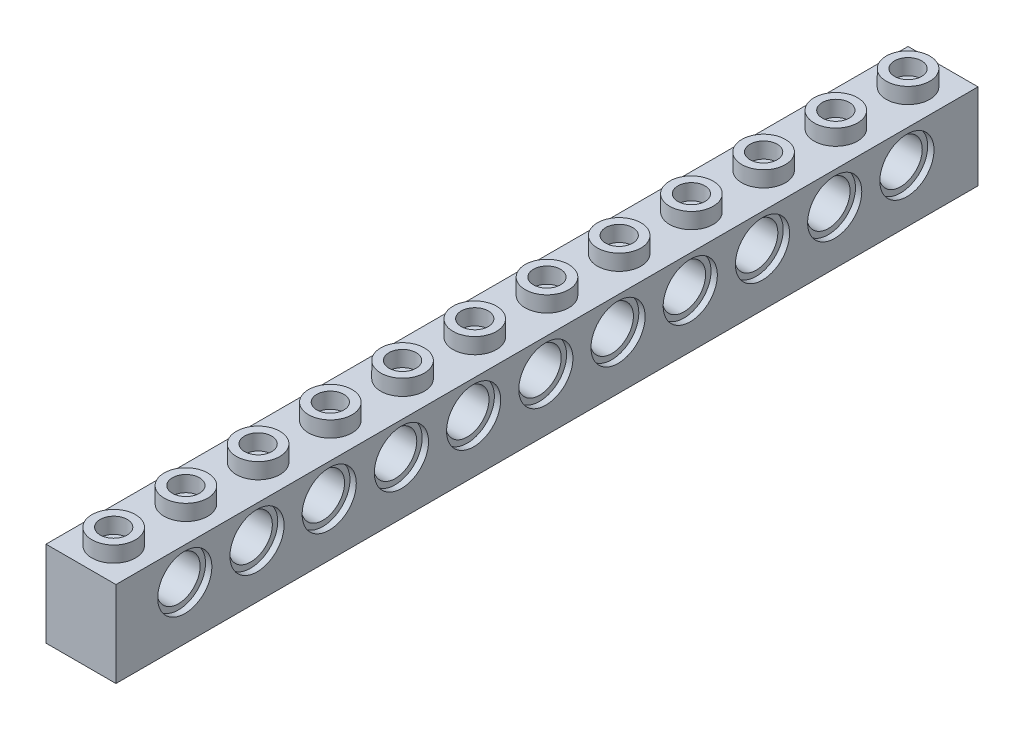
ISO-10303-21;
HEADER;
FILE_DESCRIPTION(('STEP AP214'),'2;1');
FILE_NAME('part.step','',(''),(''),'','','');
FILE_SCHEMA(('AUTOMOTIVE_DESIGN { 1 0 10303 214 1 1 1 1 }'));
ENDSEC;
DATA;
#1=APPLICATION_CONTEXT('core data for automotive mechanical design processes');
#2=APPLICATION_PROTOCOL_DEFINITION('international standard','automotive_design',2000,#1);
#3=PRODUCT_CONTEXT('',#1,'mechanical');
#4=PRODUCT('Part','Part','',(#3));
#5=PRODUCT_RELATED_PRODUCT_CATEGORY('part','',(#4));
#6=PRODUCT_DEFINITION_FORMATION('','',#4);
#7=PRODUCT_DEFINITION_CONTEXT('part definition',#1,'design');
#8=PRODUCT_DEFINITION('design','',#6,#7);
#9=PRODUCT_DEFINITION_SHAPE('','',#8);
#10=(LENGTH_UNIT() NAMED_UNIT(*) SI_UNIT(.MILLI.,.METRE.));
#11=(NAMED_UNIT(*) PLANE_ANGLE_UNIT() SI_UNIT($,.RADIAN.));
#12=(NAMED_UNIT(*) SI_UNIT($,.STERADIAN.) SOLID_ANGLE_UNIT());
#13=UNCERTAINTY_MEASURE_WITH_UNIT(LENGTH_MEASURE(1.E-05),#10,'distance_accuracy_value','');
#14=(GEOMETRIC_REPRESENTATION_CONTEXT(3) GLOBAL_UNCERTAINTY_ASSIGNED_CONTEXT((#13)) GLOBAL_UNIT_ASSIGNED_CONTEXT((#10,
#11,#12)) REPRESENTATION_CONTEXT('',''));
#15=CARTESIAN_POINT('',(0.,0.,0.));
#16=DIRECTION('',(0.,0.,1.));
#17=DIRECTION('',(1.,0.,0.));
#18=AXIS2_PLACEMENT_3D('',#15,#16,#17);
#19=CARTESIAN_POINT('',(-2.425,-3.,1.45));
#20=DIRECTION('',(0.,-1.,0.));
#21=DIRECTION('',(0.,0.,-1.));
#22=AXIS2_PLACEMENT_3D('',#19,#20,#21);
#23=PLANE('',#22);
#24=CARTESIAN_POINT('',(0.,-3.,15.9));
#25=DIRECTION('',(0.,-1.,0.));
#26=DIRECTION('',(0.,0.,-1.));
#27=AXIS2_PLACEMENT_3D('',#24,#25,#26);
#28=CIRCLE('',#27,1.5);
#29=CARTESIAN_POINT('',(0.,-3.,14.4));
#30=VERTEX_POINT('',#29);
#31=EDGE_CURVE('E522',#30,#30,#28,.T.);
#32=ORIENTED_EDGE('',*,*,#31,.F.);
#33=EDGE_LOOP('',(#32));
#34=FACE_BOUND('',#33,.T.);
#35=CARTESIAN_POINT('',(0.,-3.,31.9));
#36=DIRECTION('',(0.,-1.,0.));
#37=DIRECTION('',(0.,0.,-1.));
#38=AXIS2_PLACEMENT_3D('',#35,#36,#37);
#39=CIRCLE('',#38,1.5);
#40=CARTESIAN_POINT('',(0.,-3.,30.4));
#41=VERTEX_POINT('',#40);
#42=EDGE_CURVE('E534',#41,#41,#39,.T.);
#43=ORIENTED_EDGE('',*,*,#42,.F.);
#44=EDGE_LOOP('',(#43));
#45=FACE_BOUND('',#44,.T.);
#46=CARTESIAN_POINT('',(0.,-3.,47.9));
#47=DIRECTION('',(0.,-1.,0.));
#48=DIRECTION('',(0.,0.,-1.));
#49=AXIS2_PLACEMENT_3D('',#46,#47,#48);
#50=CIRCLE('',#49,1.5);
#51=CARTESIAN_POINT('',(0.,-3.,46.4));
#52=VERTEX_POINT('',#51);
#53=EDGE_CURVE('E546',#52,#52,#50,.T.);
#54=ORIENTED_EDGE('',*,*,#53,.F.);
#55=EDGE_LOOP('',(#54));
#56=FACE_BOUND('',#55,.T.);
#57=CARTESIAN_POINT('',(0.,-3.,63.9));
#58=DIRECTION('',(0.,-1.,0.));
#59=DIRECTION('',(0.,0.,-1.));
#60=AXIS2_PLACEMENT_3D('',#57,#58,#59);
#61=CIRCLE('',#60,1.5);
#62=CARTESIAN_POINT('',(0.,-3.,62.4));
#63=VERTEX_POINT('',#62);
#64=EDGE_CURVE('E558',#63,#63,#61,.T.);
#65=ORIENTED_EDGE('',*,*,#64,.F.);
#66=EDGE_LOOP('',(#65));
#67=FACE_BOUND('',#66,.T.);
#68=CARTESIAN_POINT('',(0.,-3.,79.9));
#69=DIRECTION('',(0.,-1.,0.));
#70=DIRECTION('',(0.,0.,-1.));
#71=AXIS2_PLACEMENT_3D('',#68,#69,#70);
#72=CIRCLE('',#71,1.5);
#73=CARTESIAN_POINT('',(0.,-3.,78.4));
#74=VERTEX_POINT('',#73);
#75=EDGE_CURVE('E570',#74,#74,#72,.T.);
#76=ORIENTED_EDGE('',*,*,#75,.F.);
#77=EDGE_LOOP('',(#76));
#78=FACE_BOUND('',#77,.T.);
#79=DIRECTION('',(0.,0.,-1.));
#80=VECTOR('',#79,1.);
#81=CARTESIAN_POINT('',(-2.425,-3.,94.05));
#82=LINE('',#81,#80);
#83=CARTESIAN_POINT('',(-2.425,-3.,94.05));
#84=VERTEX_POINT('',#83);
#85=CARTESIAN_POINT('',(-2.425,-3.,1.45));
#86=VERTEX_POINT('',#85);
#87=EDGE_CURVE('E116',#84,#86,#82,.T.);
#88=ORIENTED_EDGE('',*,*,#87,.T.);
#89=DIRECTION('',(1.,0.,0.));
#90=VECTOR('',#89,1.);
#91=CARTESIAN_POINT('',(-2.425,-3.,1.45));
#92=LINE('',#91,#90);
#93=CARTESIAN_POINT('',(2.425,-3.,1.45));
#94=VERTEX_POINT('',#93);
#95=EDGE_CURVE('E125',#86,#94,#92,.T.);
#96=ORIENTED_EDGE('',*,*,#95,.T.);
#97=DIRECTION('',(0.,0.,1.));
#98=VECTOR('',#97,1.);
#99=CARTESIAN_POINT('',(2.425,-3.,1.45));
#100=LINE('',#99,#98);
#101=CARTESIAN_POINT('',(2.425,-3.,94.05));
#102=VERTEX_POINT('',#101);
#103=EDGE_CURVE('E130',#94,#102,#100,.T.);
#104=ORIENTED_EDGE('',*,*,#103,.T.);
#105=DIRECTION('',(-1.,0.,0.));
#106=VECTOR('',#105,1.);
#107=CARTESIAN_POINT('',(2.425,-3.,94.05));
#108=LINE('',#107,#106);
#109=EDGE_CURVE('E122',#102,#84,#108,.T.);
#110=ORIENTED_EDGE('',*,*,#109,.T.);
#111=EDGE_LOOP('',(#88,#96,#104,#110));
#112=FACE_BOUND('',#111,.T.);
#113=CARTESIAN_POINT('',(0.,-3.,87.9));
#114=DIRECTION('',(0.,-1.,0.));
#115=DIRECTION('',(0.,0.,-1.));
#116=AXIS2_PLACEMENT_3D('',#113,#114,#115);
#117=CIRCLE('',#116,1.5);
#118=CARTESIAN_POINT('',(0.,-3.,86.4));
#119=VERTEX_POINT('',#118);
#120=EDGE_CURVE('E140',#119,#119,#117,.T.);
#121=ORIENTED_EDGE('',*,*,#120,.F.);
#122=EDGE_LOOP('',(#121));
#123=FACE_BOUND('',#122,.T.);
#124=CARTESIAN_POINT('',(0.,-3.,71.9));
#125=DIRECTION('',(0.,-1.,0.));
#126=DIRECTION('',(0.,0.,-1.));
#127=AXIS2_PLACEMENT_3D('',#124,#125,#126);
#128=CIRCLE('',#127,1.5);
#129=CARTESIAN_POINT('',(0.,-3.,70.4));
#130=VERTEX_POINT('',#129);
#131=EDGE_CURVE('E564',#130,#130,#128,.T.);
#132=ORIENTED_EDGE('',*,*,#131,.F.);
#133=EDGE_LOOP('',(#132));
#134=FACE_BOUND('',#133,.T.);
#135=CARTESIAN_POINT('',(0.,-3.,55.9));
#136=DIRECTION('',(0.,-1.,0.));
#137=DIRECTION('',(0.,0.,-1.));
#138=AXIS2_PLACEMENT_3D('',#135,#136,#137);
#139=CIRCLE('',#138,1.5);
#140=CARTESIAN_POINT('',(0.,-3.,54.4));
#141=VERTEX_POINT('',#140);
#142=EDGE_CURVE('E552',#141,#141,#139,.T.);
#143=ORIENTED_EDGE('',*,*,#142,.F.);
#144=EDGE_LOOP('',(#143));
#145=FACE_BOUND('',#144,.T.);
#146=CARTESIAN_POINT('',(0.,-3.,39.9));
#147=DIRECTION('',(0.,-1.,0.));
#148=DIRECTION('',(0.,0.,-1.));
#149=AXIS2_PLACEMENT_3D('',#146,#147,#148);
#150=CIRCLE('',#149,1.5);
#151=CARTESIAN_POINT('',(0.,-3.,38.4));
#152=VERTEX_POINT('',#151);
#153=EDGE_CURVE('E540',#152,#152,#150,.T.);
#154=ORIENTED_EDGE('',*,*,#153,.F.);
#155=EDGE_LOOP('',(#154));
#156=FACE_BOUND('',#155,.T.);
#157=CARTESIAN_POINT('',(0.,-3.,23.9));
#158=DIRECTION('',(0.,-1.,0.));
#159=DIRECTION('',(0.,0.,-1.));
#160=AXIS2_PLACEMENT_3D('',#157,#158,#159);
#161=CIRCLE('',#160,1.5);
#162=CARTESIAN_POINT('',(0.,-3.,22.4));
#163=VERTEX_POINT('',#162);
#164=EDGE_CURVE('E528',#163,#163,#161,.T.);
#165=ORIENTED_EDGE('',*,*,#164,.F.);
#166=EDGE_LOOP('',(#165));
#167=FACE_BOUND('',#166,.T.);
#168=CARTESIAN_POINT('',(0.,-3.,7.9));
#169=DIRECTION('',(0.,-1.,0.));
#170=DIRECTION('',(0.,0.,-1.));
#171=AXIS2_PLACEMENT_3D('',#168,#169,#170);
#172=CIRCLE('',#171,1.5);
#173=CARTESIAN_POINT('',(0.,-3.,6.4));
#174=VERTEX_POINT('',#173);
#175=EDGE_CURVE('E516',#174,#174,#172,.T.);
#176=ORIENTED_EDGE('',*,*,#175,.F.);
#177=EDGE_LOOP('',(#176));
#178=FACE_BOUND('',#177,.T.);
#179=ADVANCED_FACE('F37',(#34,#45,#56,#67,#78,#112,#123,#134,#145,#156,#167,#178),#23,.T.);
#180=CARTESIAN_POINT('',(3.875,4.75,95.5));
#181=DIRECTION('',(0.,-1.,0.));
#182=DIRECTION('',(1.,0.,0.));
#183=AXIS2_PLACEMENT_3D('',#180,#181,#182);
#184=PLANE('',#183);
#185=DIRECTION('',(-1.,0.,0.));
#186=VECTOR('',#185,1.);
#187=CARTESIAN_POINT('',(3.875,4.75,0.));
#188=LINE('',#187,#186);
#189=CARTESIAN_POINT('',(3.875,4.75,0.));
#190=VERTEX_POINT('',#189);
#191=CARTESIAN_POINT('',(-3.875,4.75,0.));
#192=VERTEX_POINT('',#191);
#193=EDGE_CURVE('E84',#190,#192,#188,.T.);
#194=ORIENTED_EDGE('',*,*,#193,.T.);
#195=DIRECTION('',(0.,0.,-1.));
#196=VECTOR('',#195,1.);
#197=CARTESIAN_POINT('',(-3.875,4.75,95.5));
#198=LINE('',#197,#196);
#199=CARTESIAN_POINT('',(-3.875,4.75,95.5));
#200=VERTEX_POINT('',#199);
#201=EDGE_CURVE('E271',#200,#192,#198,.T.);
#202=ORIENTED_EDGE('',*,*,#201,.F.);
#203=DIRECTION('',(-1.,0.,0.));
#204=VECTOR('',#203,1.);
#205=CARTESIAN_POINT('',(3.875,4.75,95.5));
#206=LINE('',#205,#204);
#207=CARTESIAN_POINT('',(3.875,4.75,95.5));
#208=VERTEX_POINT('',#207);
#209=EDGE_CURVE('E63',#208,#200,#206,.T.);
#210=ORIENTED_EDGE('',*,*,#209,.F.);
#211=DIRECTION('',(0.,0.,-1.));
#212=VECTOR('',#211,1.);
#213=CARTESIAN_POINT('',(3.875,4.75,95.5));
#214=LINE('',#213,#212);
#215=EDGE_CURVE('E280',#208,#190,#214,.T.);
#216=ORIENTED_EDGE('',*,*,#215,.T.);
#217=EDGE_LOOP('',(#194,#202,#210,#216));
#218=FACE_BOUND('',#217,.T.);
#219=CARTESIAN_POINT('',(0.,4.75,3.875));
#220=DIRECTION('',(0.,-1.,0.));
#221=DIRECTION('',(1.,0.,0.));
#222=AXIS2_PLACEMENT_3D('',#219,#220,#221);
#223=CIRCLE('',#222,2.415);
#224=CARTESIAN_POINT('',(2.415,4.75,3.875));
#225=VERTEX_POINT('',#224);
#226=EDGE_CURVE('E287',#225,#225,#223,.F.);
#227=ORIENTED_EDGE('',*,*,#226,.F.);
#228=EDGE_LOOP('',(#227));
#229=FACE_BOUND('',#228,.T.);
#230=CARTESIAN_POINT('',(0.,4.75,11.875));
#231=DIRECTION('',(0.,-1.,0.));
#232=DIRECTION('',(1.,0.,0.));
#233=AXIS2_PLACEMENT_3D('',#230,#231,#232);
#234=CIRCLE('',#233,2.415);
#235=CARTESIAN_POINT('',(2.415,4.75,11.875));
#236=VERTEX_POINT('',#235);
#237=EDGE_CURVE('E290',#236,#236,#234,.F.);
#238=ORIENTED_EDGE('',*,*,#237,.F.);
#239=EDGE_LOOP('',(#238));
#240=FACE_BOUND('',#239,.T.);
#241=CARTESIAN_POINT('',(0.,4.75,19.875));
#242=DIRECTION('',(0.,-1.,0.));
#243=DIRECTION('',(1.,0.,0.));
#244=AXIS2_PLACEMENT_3D('',#241,#242,#243);
#245=CIRCLE('',#244,2.415);
#246=CARTESIAN_POINT('',(2.415,4.75,19.875));
#247=VERTEX_POINT('',#246);
#248=EDGE_CURVE('E293',#247,#247,#245,.F.);
#249=ORIENTED_EDGE('',*,*,#248,.F.);
#250=EDGE_LOOP('',(#249));
#251=FACE_BOUND('',#250,.T.);
#252=CARTESIAN_POINT('',(0.,4.75,27.875));
#253=DIRECTION('',(0.,-1.,0.));
#254=DIRECTION('',(1.,0.,0.));
#255=AXIS2_PLACEMENT_3D('',#252,#253,#254);
#256=CIRCLE('',#255,2.415);
#257=CARTESIAN_POINT('',(2.415,4.75,27.875));
#258=VERTEX_POINT('',#257);
#259=EDGE_CURVE('E296',#258,#258,#256,.F.);
#260=ORIENTED_EDGE('',*,*,#259,.F.);
#261=EDGE_LOOP('',(#260));
#262=FACE_BOUND('',#261,.T.);
#263=CARTESIAN_POINT('',(0.,4.75,35.875));
#264=DIRECTION('',(0.,-1.,0.));
#265=DIRECTION('',(1.,0.,0.));
#266=AXIS2_PLACEMENT_3D('',#263,#264,#265);
#267=CIRCLE('',#266,2.415);
#268=CARTESIAN_POINT('',(2.415,4.75,35.875));
#269=VERTEX_POINT('',#268);
#270=EDGE_CURVE('E299',#269,#269,#267,.F.);
#271=ORIENTED_EDGE('',*,*,#270,.F.);
#272=EDGE_LOOP('',(#271));
#273=FACE_BOUND('',#272,.T.);
#274=CARTESIAN_POINT('',(0.,4.75,43.875));
#275=DIRECTION('',(0.,-1.,0.));
#276=DIRECTION('',(1.,0.,0.));
#277=AXIS2_PLACEMENT_3D('',#274,#275,#276);
#278=CIRCLE('',#277,2.415);
#279=CARTESIAN_POINT('',(2.415,4.75,43.875));
#280=VERTEX_POINT('',#279);
#281=EDGE_CURVE('E302',#280,#280,#278,.F.);
#282=ORIENTED_EDGE('',*,*,#281,.F.);
#283=EDGE_LOOP('',(#282));
#284=FACE_BOUND('',#283,.T.);
#285=CARTESIAN_POINT('',(0.,4.75,51.875));
#286=DIRECTION('',(0.,-1.,0.));
#287=DIRECTION('',(1.,0.,0.));
#288=AXIS2_PLACEMENT_3D('',#285,#286,#287);
#289=CIRCLE('',#288,2.415);
#290=CARTESIAN_POINT('',(2.415,4.75,51.875));
#291=VERTEX_POINT('',#290);
#292=EDGE_CURVE('E305',#291,#291,#289,.F.);
#293=ORIENTED_EDGE('',*,*,#292,.F.);
#294=EDGE_LOOP('',(#293));
#295=FACE_BOUND('',#294,.T.);
#296=CARTESIAN_POINT('',(0.,4.75,59.875));
#297=DIRECTION('',(0.,-1.,0.));
#298=DIRECTION('',(1.,0.,0.));
#299=AXIS2_PLACEMENT_3D('',#296,#297,#298);
#300=CIRCLE('',#299,2.415);
#301=CARTESIAN_POINT('',(2.415,4.75,59.875));
#302=VERTEX_POINT('',#301);
#303=EDGE_CURVE('E308',#302,#302,#300,.F.);
#304=ORIENTED_EDGE('',*,*,#303,.F.);
#305=EDGE_LOOP('',(#304));
#306=FACE_BOUND('',#305,.T.);
#307=CARTESIAN_POINT('',(0.,4.75,67.875));
#308=DIRECTION('',(0.,-1.,0.));
#309=DIRECTION('',(1.,0.,0.));
#310=AXIS2_PLACEMENT_3D('',#307,#308,#309);
#311=CIRCLE('',#310,2.415);
#312=CARTESIAN_POINT('',(2.415,4.75,67.875));
#313=VERTEX_POINT('',#312);
#314=EDGE_CURVE('E311',#313,#313,#311,.F.);
#315=ORIENTED_EDGE('',*,*,#314,.F.);
#316=EDGE_LOOP('',(#315));
#317=FACE_BOUND('',#316,.T.);
#318=CARTESIAN_POINT('',(0.,4.75,75.875));
#319=DIRECTION('',(0.,-1.,0.));
#320=DIRECTION('',(1.,0.,0.));
#321=AXIS2_PLACEMENT_3D('',#318,#319,#320);
#322=CIRCLE('',#321,2.415);
#323=CARTESIAN_POINT('',(2.415,4.75,75.875));
#324=VERTEX_POINT('',#323);
#325=EDGE_CURVE('E314',#324,#324,#322,.F.);
#326=ORIENTED_EDGE('',*,*,#325,.F.);
#327=EDGE_LOOP('',(#326));
#328=FACE_BOUND('',#327,.T.);
#329=CARTESIAN_POINT('',(0.,4.75,83.875));
#330=DIRECTION('',(0.,-1.,0.));
#331=DIRECTION('',(1.,0.,0.));
#332=AXIS2_PLACEMENT_3D('',#329,#330,#331);
#333=CIRCLE('',#332,2.415);
#334=CARTESIAN_POINT('',(2.415,4.75,83.875));
#335=VERTEX_POINT('',#334);
#336=EDGE_CURVE('E317',#335,#335,#333,.F.);
#337=ORIENTED_EDGE('',*,*,#336,.F.);
#338=EDGE_LOOP('',(#337));
#339=FACE_BOUND('',#338,.T.);
#340=CARTESIAN_POINT('',(0.,4.75,91.875));
#341=DIRECTION('',(0.,-1.,0.));
#342=DIRECTION('',(1.,0.,0.));
#343=AXIS2_PLACEMENT_3D('',#340,#341,#342);
#344=CIRCLE('',#343,2.415);
#345=CARTESIAN_POINT('',(2.415,4.75,91.875));
#346=VERTEX_POINT('',#345);
#347=EDGE_CURVE('E320',#346,#346,#344,.F.);
#348=ORIENTED_EDGE('',*,*,#347,.F.);
#349=EDGE_LOOP('',(#348));
#350=FACE_BOUND('',#349,.T.);
#351=ADVANCED_FACE('F586',(#218,#229,#240,#251,#262,#273,#284,#295,#306,#317,#328,#339,#350),
#184,.F.);
#352=CARTESIAN_POINT('',(-3.875,-4.75,95.5));
#353=DIRECTION('',(1.,0.,0.));
#354=DIRECTION('',(0.,0.,-1.));
#355=AXIS2_PLACEMENT_3D('',#352,#353,#354);
#356=PLANE('',#355);
#357=CARTESIAN_POINT('',(-3.875,1.15,79.875));
#358=DIRECTION('',(-1.,0.,0.));
#359=DIRECTION('',(0.,0.,1.));
#360=AXIS2_PLACEMENT_3D('',#357,#358,#359);
#361=CIRCLE('',#360,3.00000000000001);
#362=CARTESIAN_POINT('',(-3.875,1.15,82.875));
#363=VERTEX_POINT('',#362);
#364=EDGE_CURVE('E497',#363,#363,#361,.T.);
#365=ORIENTED_EDGE('',*,*,#364,.F.);
#366=EDGE_LOOP('',(#365));
#367=FACE_BOUND('',#366,.T.);
#368=CARTESIAN_POINT('',(-3.875,1.15,87.875));
#369=DIRECTION('',(-1.,0.,0.));
#370=DIRECTION('',(0.,0.,1.));
#371=AXIS2_PLACEMENT_3D('',#368,#369,#370);
#372=CIRCLE('',#371,3.00000000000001);
#373=CARTESIAN_POINT('',(-3.875,1.15,90.875));
#374=VERTEX_POINT('',#373);
#375=EDGE_CURVE('E510',#374,#374,#372,.T.);
#376=ORIENTED_EDGE('',*,*,#375,.F.);
#377=EDGE_LOOP('',(#376));
#378=FACE_BOUND('',#377,.T.);
#379=DIRECTION('',(0.,-1.,0.));
#380=VECTOR('',#379,1.);
#381=CARTESIAN_POINT('',(-3.875,-4.75,0.));
#382=LINE('',#381,#380);
#383=CARTESIAN_POINT('',(-3.875,-4.75,0.));
#384=VERTEX_POINT('',#383);
#385=EDGE_CURVE('E264',#192,#384,#382,.T.);
#386=ORIENTED_EDGE('',*,*,#385,.T.);
#387=DIRECTION('',(0.,0.,-1.));
#388=VECTOR('',#387,1.);
#389=CARTESIAN_POINT('',(-3.875,-4.75,95.5));
#390=LINE('',#389,#388);
#391=CARTESIAN_POINT('',(-3.875,-4.75,95.5));
#392=VERTEX_POINT('',#391);
#393=EDGE_CURVE('E285',#392,#384,#390,.T.);
#394=ORIENTED_EDGE('',*,*,#393,.F.);
#395=DIRECTION('',(0.,-1.,0.));
#396=VECTOR('',#395,1.);
#397=CARTESIAN_POINT('',(-3.875,-4.75,95.5));
#398=LINE('',#397,#396);
#399=EDGE_CURVE('E265',#200,#392,#398,.T.);
#400=ORIENTED_EDGE('',*,*,#399,.F.);
#401=ORIENTED_EDGE('',*,*,#201,.T.);
#402=EDGE_LOOP('',(#386,#394,#400,#401));
#403=FACE_BOUND('',#402,.T.);
#404=CARTESIAN_POINT('',(-3.875,1.15,71.875));
#405=DIRECTION('',(-1.,0.,0.));
#406=DIRECTION('',(0.,0.,1.));
#407=AXIS2_PLACEMENT_3D('',#404,#405,#406);
#408=CIRCLE('',#407,3.00000000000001);
#409=CARTESIAN_POINT('',(-3.875,1.15,74.875));
#410=VERTEX_POINT('',#409);
#411=EDGE_CURVE('E323',#410,#410,#408,.T.);
#412=ORIENTED_EDGE('',*,*,#411,.F.);
#413=EDGE_LOOP('',(#412));
#414=FACE_BOUND('',#413,.T.);
#415=CARTESIAN_POINT('',(-3.875,1.15,63.875));
#416=DIRECTION('',(-1.,0.,0.));
#417=DIRECTION('',(0.,0.,1.));
#418=AXIS2_PLACEMENT_3D('',#415,#416,#417);
#419=CIRCLE('',#418,3.00000000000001);
#420=CARTESIAN_POINT('',(-3.875,1.15,66.875));
#421=VERTEX_POINT('',#420);
#422=EDGE_CURVE('E334',#421,#421,#419,.T.);
#423=ORIENTED_EDGE('',*,*,#422,.F.);
#424=EDGE_LOOP('',(#423));
#425=FACE_BOUND('',#424,.T.);
#426=CARTESIAN_POINT('',(-3.875,1.15,55.875));
#427=DIRECTION('',(-1.,0.,0.));
#428=DIRECTION('',(0.,0.,1.));
#429=AXIS2_PLACEMENT_3D('',#426,#427,#428);
#430=CIRCLE('',#429,3.00000000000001);
#431=CARTESIAN_POINT('',(-3.875,1.15,58.875));
#432=VERTEX_POINT('',#431);
#433=EDGE_CURVE('E340',#432,#432,#430,.T.);
#434=ORIENTED_EDGE('',*,*,#433,.F.);
#435=EDGE_LOOP('',(#434));
#436=FACE_BOUND('',#435,.T.);
#437=CARTESIAN_POINT('',(-3.875,1.15,47.875));
#438=DIRECTION('',(-1.,0.,0.));
#439=DIRECTION('',(0.,0.,1.));
#440=AXIS2_PLACEMENT_3D('',#437,#438,#439);
#441=CIRCLE('',#440,3.00000000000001);
#442=CARTESIAN_POINT('',(-3.875,1.15,50.875));
#443=VERTEX_POINT('',#442);
#444=EDGE_CURVE('E346',#443,#443,#441,.T.);
#445=ORIENTED_EDGE('',*,*,#444,.F.);
#446=EDGE_LOOP('',(#445));
#447=FACE_BOUND('',#446,.T.);
#448=CARTESIAN_POINT('',(-3.875,1.15,39.875));
#449=DIRECTION('',(-1.,0.,0.));
#450=DIRECTION('',(0.,0.,1.));
#451=AXIS2_PLACEMENT_3D('',#448,#449,#450);
#452=CIRCLE('',#451,3.00000000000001);
#453=CARTESIAN_POINT('',(-3.875,1.15,42.875));
#454=VERTEX_POINT('',#453);
#455=EDGE_CURVE('E352',#454,#454,#452,.T.);
#456=ORIENTED_EDGE('',*,*,#455,.F.);
#457=EDGE_LOOP('',(#456));
#458=FACE_BOUND('',#457,.T.);
#459=CARTESIAN_POINT('',(-3.875,1.15,31.875));
#460=DIRECTION('',(-1.,0.,0.));
#461=DIRECTION('',(0.,0.,1.));
#462=AXIS2_PLACEMENT_3D('',#459,#460,#461);
#463=CIRCLE('',#462,3.00000000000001);
#464=CARTESIAN_POINT('',(-3.875,1.15,34.875));
#465=VERTEX_POINT('',#464);
#466=EDGE_CURVE('E358',#465,#465,#463,.T.);
#467=ORIENTED_EDGE('',*,*,#466,.F.);
#468=EDGE_LOOP('',(#467));
#469=FACE_BOUND('',#468,.T.);
#470=CARTESIAN_POINT('',(-3.875,1.15,23.875));
#471=DIRECTION('',(-1.,0.,0.));
#472=DIRECTION('',(0.,0.,1.));
#473=AXIS2_PLACEMENT_3D('',#470,#471,#472);
#474=CIRCLE('',#473,3.00000000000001);
#475=CARTESIAN_POINT('',(-3.875,1.15,26.875));
#476=VERTEX_POINT('',#475);
#477=EDGE_CURVE('E364',#476,#476,#474,.T.);
#478=ORIENTED_EDGE('',*,*,#477,.F.);
#479=EDGE_LOOP('',(#478));
#480=FACE_BOUND('',#479,.T.);
#481=CARTESIAN_POINT('',(-3.875,1.15,15.875));
#482=DIRECTION('',(-1.,0.,0.));
#483=DIRECTION('',(0.,0.,1.));
#484=AXIS2_PLACEMENT_3D('',#481,#482,#483);
#485=CIRCLE('',#484,3.00000000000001);
#486=CARTESIAN_POINT('',(-3.875,1.15,18.875));
#487=VERTEX_POINT('',#486);
#488=EDGE_CURVE('E370',#487,#487,#485,.T.);
#489=ORIENTED_EDGE('',*,*,#488,.F.);
#490=EDGE_LOOP('',(#489));
#491=FACE_BOUND('',#490,.T.);
#492=CARTESIAN_POINT('',(-3.875,1.15,7.87499999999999));
#493=DIRECTION('',(-1.,0.,0.));
#494=DIRECTION('',(0.,0.,1.));
#495=AXIS2_PLACEMENT_3D('',#492,#493,#494);
#496=CIRCLE('',#495,3.00000000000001);
#497=CARTESIAN_POINT('',(-3.875,1.15,10.875));
#498=VERTEX_POINT('',#497);
#499=EDGE_CURVE('E46',#498,#498,#496,.T.);
#500=ORIENTED_EDGE('',*,*,#499,.F.);
#501=EDGE_LOOP('',(#500));
#502=FACE_BOUND('',#501,.T.);
#503=ADVANCED_FACE('F876',(#367,#378,#403,#414,#425,#436,#447,#458,#469,#480,#491,#502),#356,.F.);
#504=CARTESIAN_POINT('',(3.875,-4.75,95.5));
#505=DIRECTION('',(0.,1.,0.));
#506=DIRECTION('',(0.,0.,1.));
#507=AXIS2_PLACEMENT_3D('',#504,#505,#506);
#508=PLANE('',#507);
#509=DIRECTION('',(1.,0.,0.));
#510=VECTOR('',#509,1.);
#511=CARTESIAN_POINT('',(-2.425,-4.75,1.45));
#512=LINE('',#511,#510);
#513=CARTESIAN_POINT('',(-2.425,-4.75,1.45000000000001));
#514=VERTEX_POINT('',#513);
#515=CARTESIAN_POINT('',(2.425,-4.75,1.45));
#516=VERTEX_POINT('',#515);
#517=EDGE_CURVE('E146',#514,#516,#512,.T.);
#518=ORIENTED_EDGE('',*,*,#517,.F.);
#519=DIRECTION('',(0.,0.,-1.));
#520=VECTOR('',#519,1.);
#521=CARTESIAN_POINT('',(-2.425,-4.75,94.05));
#522=LINE('',#521,#520);
#523=CARTESIAN_POINT('',(-2.425,-4.75,94.05));
#524=VERTEX_POINT('',#523);
#525=EDGE_CURVE('E54',#524,#514,#522,.T.);
#526=ORIENTED_EDGE('',*,*,#525,.F.);
#527=DIRECTION('',(-1.,0.,0.));
#528=VECTOR('',#527,1.);
#529=CARTESIAN_POINT('',(2.425,-4.75,94.05));
#530=LINE('',#529,#528);
#531=CARTESIAN_POINT('',(2.425,-4.75,94.05));
#532=VERTEX_POINT('',#531);
#533=EDGE_CURVE('E134',#532,#524,#530,.T.);
#534=ORIENTED_EDGE('',*,*,#533,.F.);
#535=DIRECTION('',(0.,0.,1.));
#536=VECTOR('',#535,1.);
#537=CARTESIAN_POINT('',(2.425,-4.75,1.45));
#538=LINE('',#537,#536);
#539=EDGE_CURVE('E137',#516,#532,#538,.T.);
#540=ORIENTED_EDGE('',*,*,#539,.F.);
#541=EDGE_LOOP('',(#518,#526,#534,#540));
#542=FACE_BOUND('',#541,.T.);
#543=DIRECTION('',(1.,0.,0.));
#544=VECTOR('',#543,1.);
#545=CARTESIAN_POINT('',(3.875,-4.75,0.));
#546=LINE('',#545,#544);
#547=CARTESIAN_POINT('',(3.875,-4.75,0.));
#548=VERTEX_POINT('',#547);
#549=EDGE_CURVE('E274',#384,#548,#546,.T.);
#550=ORIENTED_EDGE('',*,*,#549,.T.);
#551=DIRECTION('',(0.,0.,-1.));
#552=VECTOR('',#551,1.);
#553=CARTESIAN_POINT('',(3.875,-4.75,95.5));
#554=LINE('',#553,#552);
#555=CARTESIAN_POINT('',(3.875,-4.75,95.5));
#556=VERTEX_POINT('',#555);
#557=EDGE_CURVE('E282',#556,#548,#554,.T.);
#558=ORIENTED_EDGE('',*,*,#557,.F.);
#559=DIRECTION('',(1.,0.,0.));
#560=VECTOR('',#559,1.);
#561=CARTESIAN_POINT('',(3.875,-4.75,95.5));
#562=LINE('',#561,#560);
#563=EDGE_CURVE('E92',#392,#556,#562,.T.);
#564=ORIENTED_EDGE('',*,*,#563,.F.);
#565=ORIENTED_EDGE('',*,*,#393,.T.);
#566=EDGE_LOOP('',(#550,#558,#564,#565));
#567=FACE_BOUND('',#566,.T.);
#568=ADVANCED_FACE('F872',(#542,#567),#508,.F.);
#569=CARTESIAN_POINT('',(3.875,-4.75,95.5));
#570=DIRECTION('',(-1.,0.,0.));
#571=DIRECTION('',(0.,0.,1.));
#572=AXIS2_PLACEMENT_3D('',#569,#570,#571);
#573=PLANE('',#572);
#574=CARTESIAN_POINT('',(3.875,1.15,7.87499999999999));
#575=DIRECTION('',(1.,0.,0.));
#576=DIRECTION('',(0.,0.,-1.));
#577=AXIS2_PLACEMENT_3D('',#574,#575,#576);
#578=CIRCLE('',#577,3.00000000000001);
#579=CARTESIAN_POINT('',(3.875,1.15,4.87499999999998));
#580=VERTEX_POINT('',#579);
#581=EDGE_CURVE('E439',#580,#580,#578,.T.);
#582=ORIENTED_EDGE('',*,*,#581,.F.);
#583=EDGE_LOOP('',(#582));
#584=FACE_BOUND('',#583,.T.);
#585=CARTESIAN_POINT('',(3.875,1.15,15.875));
#586=DIRECTION('',(1.,0.,0.));
#587=DIRECTION('',(0.,0.,-1.));
#588=AXIS2_PLACEMENT_3D('',#585,#586,#587);
#589=CIRCLE('',#588,3.00000000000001);
#590=CARTESIAN_POINT('',(3.875,1.15,12.875));
#591=VERTEX_POINT('',#590);
#592=EDGE_CURVE('E443',#591,#591,#589,.T.);
#593=ORIENTED_EDGE('',*,*,#592,.F.);
#594=EDGE_LOOP('',(#593));
#595=FACE_BOUND('',#594,.T.);
#596=CARTESIAN_POINT('',(3.875,1.15,23.875));
#597=DIRECTION('',(1.,0.,0.));
#598=DIRECTION('',(0.,0.,-1.));
#599=AXIS2_PLACEMENT_3D('',#596,#597,#598);
#600=CIRCLE('',#599,3.00000000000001);
#601=CARTESIAN_POINT('',(3.875,1.15,20.875));
#602=VERTEX_POINT('',#601);
#603=EDGE_CURVE('E449',#602,#602,#600,.T.);
#604=ORIENTED_EDGE('',*,*,#603,.F.);
#605=EDGE_LOOP('',(#604));
#606=FACE_BOUND('',#605,.T.);
#607=CARTESIAN_POINT('',(3.875,1.15,31.875));
#608=DIRECTION('',(1.,0.,0.));
#609=DIRECTION('',(0.,0.,-1.));
#610=AXIS2_PLACEMENT_3D('',#607,#608,#609);
#611=CIRCLE('',#610,3.00000000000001);
#612=CARTESIAN_POINT('',(3.875,1.15,28.875));
#613=VERTEX_POINT('',#612);
#614=EDGE_CURVE('E455',#613,#613,#611,.T.);
#615=ORIENTED_EDGE('',*,*,#614,.F.);
#616=EDGE_LOOP('',(#615));
#617=FACE_BOUND('',#616,.T.);
#618=CARTESIAN_POINT('',(3.875,1.15,39.875));
#619=DIRECTION('',(1.,0.,0.));
#620=DIRECTION('',(0.,0.,-1.));
#621=AXIS2_PLACEMENT_3D('',#618,#619,#620);
#622=CIRCLE('',#621,3.00000000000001);
#623=CARTESIAN_POINT('',(3.875,1.15,36.875));
#624=VERTEX_POINT('',#623);
#625=EDGE_CURVE('E461',#624,#624,#622,.T.);
#626=ORIENTED_EDGE('',*,*,#625,.F.);
#627=EDGE_LOOP('',(#626));
#628=FACE_BOUND('',#627,.T.);
#629=CARTESIAN_POINT('',(3.875,1.15,47.875));
#630=DIRECTION('',(1.,0.,0.));
#631=DIRECTION('',(0.,0.,-1.));
#632=AXIS2_PLACEMENT_3D('',#629,#630,#631);
#633=CIRCLE('',#632,3.00000000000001);
#634=CARTESIAN_POINT('',(3.875,1.15,44.875));
#635=VERTEX_POINT('',#634);
#636=EDGE_CURVE('E467',#635,#635,#633,.T.);
#637=ORIENTED_EDGE('',*,*,#636,.F.);
#638=EDGE_LOOP('',(#637));
#639=FACE_BOUND('',#638,.T.);
#640=CARTESIAN_POINT('',(3.875,1.15,55.875));
#641=DIRECTION('',(1.,0.,0.));
#642=DIRECTION('',(0.,0.,-1.));
#643=AXIS2_PLACEMENT_3D('',#640,#641,#642);
#644=CIRCLE('',#643,3.00000000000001);
#645=CARTESIAN_POINT('',(3.875,1.15,52.875));
#646=VERTEX_POINT('',#645);
#647=EDGE_CURVE('E473',#646,#646,#644,.T.);
#648=ORIENTED_EDGE('',*,*,#647,.F.);
#649=EDGE_LOOP('',(#648));
#650=FACE_BOUND('',#649,.T.);
#651=CARTESIAN_POINT('',(3.875,1.15,63.875));
#652=DIRECTION('',(1.,0.,0.));
#653=DIRECTION('',(0.,0.,-1.));
#654=AXIS2_PLACEMENT_3D('',#651,#652,#653);
#655=CIRCLE('',#654,3.00000000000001);
#656=CARTESIAN_POINT('',(3.875,1.15,60.875));
#657=VERTEX_POINT('',#656);
#658=EDGE_CURVE('E479',#657,#657,#655,.T.);
#659=ORIENTED_EDGE('',*,*,#658,.F.);
#660=EDGE_LOOP('',(#659));
#661=FACE_BOUND('',#660,.T.);
#662=CARTESIAN_POINT('',(3.875,1.15,71.875));
#663=DIRECTION('',(1.,0.,0.));
#664=DIRECTION('',(0.,0.,-1.));
#665=AXIS2_PLACEMENT_3D('',#662,#663,#664);
#666=CIRCLE('',#665,3.00000000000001);
#667=CARTESIAN_POINT('',(3.875,1.15,68.875));
#668=VERTEX_POINT('',#667);
#669=EDGE_CURVE('E485',#668,#668,#666,.T.);
#670=ORIENTED_EDGE('',*,*,#669,.F.);
#671=EDGE_LOOP('',(#670));
#672=FACE_BOUND('',#671,.T.);
#673=CARTESIAN_POINT('',(3.875,1.15,79.875));
#674=DIRECTION('',(1.,0.,0.));
#675=DIRECTION('',(0.,0.,-1.));
#676=AXIS2_PLACEMENT_3D('',#673,#674,#675);
#677=CIRCLE('',#676,3.00000000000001);
#678=CARTESIAN_POINT('',(3.875,1.15,76.875));
#679=VERTEX_POINT('',#678);
#680=EDGE_CURVE('E491',#679,#679,#677,.T.);
#681=ORIENTED_EDGE('',*,*,#680,.F.);
#682=EDGE_LOOP('',(#681));
#683=FACE_BOUND('',#682,.T.);
#684=CARTESIAN_POINT('',(3.875,1.15,87.875));
#685=DIRECTION('',(1.,0.,0.));
#686=DIRECTION('',(0.,0.,-1.));
#687=AXIS2_PLACEMENT_3D('',#684,#685,#686);
#688=CIRCLE('',#687,3.00000000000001);
#689=CARTESIAN_POINT('',(3.875,1.15,84.875));
#690=VERTEX_POINT('',#689);
#691=EDGE_CURVE('E506',#690,#690,#688,.T.);
#692=ORIENTED_EDGE('',*,*,#691,.F.);
#693=EDGE_LOOP('',(#692));
#694=FACE_BOUND('',#693,.T.);
#695=DIRECTION('',(0.,1.,0.));
#696=VECTOR('',#695,1.);
#697=CARTESIAN_POINT('',(3.875,-4.75,0.));
#698=LINE('',#697,#696);
#699=EDGE_CURVE('E276',#548,#190,#698,.T.);
#700=ORIENTED_EDGE('',*,*,#699,.T.);
#701=ORIENTED_EDGE('',*,*,#215,.F.);
#702=DIRECTION('',(0.,1.,0.));
#703=VECTOR('',#702,1.);
#704=CARTESIAN_POINT('',(3.875,-4.75,95.5));
#705=LINE('',#704,#703);
#706=EDGE_CURVE('E268',#556,#208,#705,.T.);
#707=ORIENTED_EDGE('',*,*,#706,.F.);
#708=ORIENTED_EDGE('',*,*,#557,.T.);
#709=EDGE_LOOP('',(#700,#701,#707,#708));
#710=FACE_BOUND('',#709,.T.);
#711=ADVANCED_FACE('F863',(#584,#595,#606,#617,#628,#639,#650,#661,#672,#683,#694,#710),#573,.F.);
#712=CARTESIAN_POINT('',(-3.875,4.75,95.5));
#713=DIRECTION('',(0.,0.,1.));
#714=DIRECTION('',(1.,0.,0.));
#715=AXIS2_PLACEMENT_3D('',#712,#713,#714);
#716=PLANE('',#715);
#717=ORIENTED_EDGE('',*,*,#399,.T.);
#718=ORIENTED_EDGE('',*,*,#563,.T.);
#719=ORIENTED_EDGE('',*,*,#706,.T.);
#720=ORIENTED_EDGE('',*,*,#209,.T.);
#721=EDGE_LOOP('',(#717,#718,#719,#720));
#722=FACE_BOUND('',#721,.T.);
#723=ADVANCED_FACE('F860',(#722),#716,.T.);
#724=CARTESIAN_POINT('',(-3.875,4.75,0.));
#725=DIRECTION('',(0.,0.,1.));
#726=DIRECTION('',(1.,0.,0.));
#727=AXIS2_PLACEMENT_3D('',#724,#725,#726);
#728=PLANE('',#727);
#729=ORIENTED_EDGE('',*,*,#385,.F.);
#730=ORIENTED_EDGE('',*,*,#193,.F.);
#731=ORIENTED_EDGE('',*,*,#699,.F.);
#732=ORIENTED_EDGE('',*,*,#549,.F.);
#733=EDGE_LOOP('',(#729,#730,#731,#732));
#734=FACE_BOUND('',#733,.T.);
#735=ADVANCED_FACE('F855',(#734),#728,.F.);
#736=CARTESIAN_POINT('',(0.,6.5,3.875));
#737=DIRECTION('',(0.,1.,0.));
#738=DIRECTION('',(-1.,0.,0.));
#739=AXIS2_PLACEMENT_3D('',#736,#737,#738);
#740=PLANE('',#739);
#741=CARTESIAN_POINT('',(0.,6.5,3.875));
#742=DIRECTION('',(0.,1.,0.));
#743=DIRECTION('',(-1.,0.,0.));
#744=AXIS2_PLACEMENT_3D('',#741,#742,#743);
#745=CIRCLE('',#744,2.415);
#746=CARTESIAN_POINT('',(-2.415,6.5,3.875));
#747=VERTEX_POINT('',#746);
#748=EDGE_CURVE('E259',#747,#747,#745,.T.);
#749=ORIENTED_EDGE('',*,*,#748,.T.);
#750=EDGE_LOOP('',(#749));
#751=FACE_BOUND('',#750,.T.);
#752=CARTESIAN_POINT('',(0.,6.5,3.875));
#753=DIRECTION('',(0.,1.,0.));
#754=DIRECTION('',(-1.,0.,0.));
#755=AXIS2_PLACEMENT_3D('',#752,#753,#754);
#756=CIRCLE('',#755,1.5);
#757=CARTESIAN_POINT('',(-1.5,6.5,3.875));
#758=VERTEX_POINT('',#757);
#759=EDGE_CURVE('E256',#758,#758,#756,.T.);
#760=ORIENTED_EDGE('',*,*,#759,.F.);
#761=EDGE_LOOP('',(#760));
#762=FACE_BOUND('',#761,.T.);
#763=ADVANCED_FACE('F852',(#751,#762),#740,.T.);
#764=CARTESIAN_POINT('',(0.,6.5,3.875));
#765=DIRECTION('',(0.,-1.,0.));
#766=DIRECTION('',(1.,0.,0.));
#767=AXIS2_PLACEMENT_3D('',#764,#765,#766);
#768=CYLINDRICAL_SURFACE('',#767,2.415);
#769=ORIENTED_EDGE('',*,*,#748,.F.);
#770=EDGE_LOOP('',(#769));
#771=FACE_BOUND('',#770,.T.);
#772=ORIENTED_EDGE('',*,*,#226,.T.);
#773=EDGE_LOOP('',(#772));
#774=FACE_BOUND('',#773,.T.);
#775=ADVANCED_FACE('F850',(#771,#774),#768,.T.);
#776=CARTESIAN_POINT('',(0.,6.5,3.875));
#777=DIRECTION('',(0.,-1.,0.));
#778=DIRECTION('',(1.,0.,0.));
#779=AXIS2_PLACEMENT_3D('',#776,#777,#778);
#780=CYLINDRICAL_SURFACE('',#779,1.5);
#781=ORIENTED_EDGE('',*,*,#759,.T.);
#782=EDGE_LOOP('',(#781));
#783=FACE_BOUND('',#782,.T.);
#784=CARTESIAN_POINT('',(0.,4.75,3.875));
#785=DIRECTION('',(0.,1.,0.));
#786=DIRECTION('',(-1.,0.,0.));
#787=AXIS2_PLACEMENT_3D('',#784,#785,#786);
#788=CIRCLE('',#787,1.5);
#789=CARTESIAN_POINT('',(-1.5,4.75,3.875));
#790=VERTEX_POINT('',#789);
#791=EDGE_CURVE('E255',#790,#790,#788,.T.);
#792=ORIENTED_EDGE('',*,*,#791,.F.);
#793=EDGE_LOOP('',(#792));
#794=FACE_BOUND('',#793,.T.);
#795=ADVANCED_FACE('F847',(#783,#794),#780,.F.);
#796=ORIENTED_EDGE('',*,*,#791,.T.);
#797=EDGE_LOOP('',(#796));
#798=FACE_BOUND('',#797,.T.);
#799=ADVANCED_FACE('F842',(#798),#184,.F.);
#800=CARTESIAN_POINT('',(0.,6.5,11.875));
#801=DIRECTION('',(0.,1.,0.));
#802=DIRECTION('',(-1.,0.,0.));
#803=AXIS2_PLACEMENT_3D('',#800,#801,#802);
#804=PLANE('',#803);
#805=CARTESIAN_POINT('',(0.,6.5,11.875));
#806=DIRECTION('',(0.,1.,0.));
#807=DIRECTION('',(-1.,0.,0.));
#808=AXIS2_PLACEMENT_3D('',#805,#806,#807);
#809=CIRCLE('',#808,2.415);
#810=CARTESIAN_POINT('',(-2.415,6.5,11.875));
#811=VERTEX_POINT('',#810);
#812=EDGE_CURVE('E250',#811,#811,#809,.T.);
#813=ORIENTED_EDGE('',*,*,#812,.T.);
#814=EDGE_LOOP('',(#813));
#815=FACE_BOUND('',#814,.T.);
#816=CARTESIAN_POINT('',(0.,6.5,11.875));
#817=DIRECTION('',(0.,1.,0.));
#818=DIRECTION('',(-1.,0.,0.));
#819=AXIS2_PLACEMENT_3D('',#816,#817,#818);
#820=CIRCLE('',#819,1.5);
#821=CARTESIAN_POINT('',(-1.5,6.5,11.875));
#822=VERTEX_POINT('',#821);
#823=EDGE_CURVE('E247',#822,#822,#820,.T.);
#824=ORIENTED_EDGE('',*,*,#823,.F.);
#825=EDGE_LOOP('',(#824));
#826=FACE_BOUND('',#825,.T.);
#827=ADVANCED_FACE('F839',(#815,#826),#804,.T.);
#828=CARTESIAN_POINT('',(0.,6.5,11.875));
#829=DIRECTION('',(0.,-1.,0.));
#830=DIRECTION('',(1.,0.,0.));
#831=AXIS2_PLACEMENT_3D('',#828,#829,#830);
#832=CYLINDRICAL_SURFACE('',#831,2.415);
#833=ORIENTED_EDGE('',*,*,#812,.F.);
#834=EDGE_LOOP('',(#833));
#835=FACE_BOUND('',#834,.T.);
#836=ORIENTED_EDGE('',*,*,#237,.T.);
#837=EDGE_LOOP('',(#836));
#838=FACE_BOUND('',#837,.T.);
#839=ADVANCED_FACE('F837',(#835,#838),#832,.T.);
#840=CARTESIAN_POINT('',(0.,6.5,11.875));
#841=DIRECTION('',(0.,-1.,0.));
#842=DIRECTION('',(1.,0.,0.));
#843=AXIS2_PLACEMENT_3D('',#840,#841,#842);
#844=CYLINDRICAL_SURFACE('',#843,1.5);
#845=ORIENTED_EDGE('',*,*,#823,.T.);
#846=EDGE_LOOP('',(#845));
#847=FACE_BOUND('',#846,.T.);
#848=CARTESIAN_POINT('',(0.,4.75,11.875));
#849=DIRECTION('',(0.,1.,0.));
#850=DIRECTION('',(-1.,0.,0.));
#851=AXIS2_PLACEMENT_3D('',#848,#849,#850);
#852=CIRCLE('',#851,1.5);
#853=CARTESIAN_POINT('',(-1.5,4.75,11.875));
#854=VERTEX_POINT('',#853);
#855=EDGE_CURVE('E246',#854,#854,#852,.T.);
#856=ORIENTED_EDGE('',*,*,#855,.F.);
#857=EDGE_LOOP('',(#856));
#858=FACE_BOUND('',#857,.T.);
#859=ADVANCED_FACE('F834',(#847,#858),#844,.F.);
#860=ORIENTED_EDGE('',*,*,#855,.T.);
#861=EDGE_LOOP('',(#860));
#862=FACE_BOUND('',#861,.T.);
#863=ADVANCED_FACE('F829',(#862),#184,.F.);
#864=CARTESIAN_POINT('',(0.,6.5,19.875));
#865=DIRECTION('',(0.,1.,0.));
#866=DIRECTION('',(-1.,0.,0.));
#867=AXIS2_PLACEMENT_3D('',#864,#865,#866);
#868=PLANE('',#867);
#869=CARTESIAN_POINT('',(0.,6.5,19.875));
#870=DIRECTION('',(0.,1.,0.));
#871=DIRECTION('',(-1.,0.,0.));
#872=AXIS2_PLACEMENT_3D('',#869,#870,#871);
#873=CIRCLE('',#872,2.415);
#874=CARTESIAN_POINT('',(-2.415,6.5,19.875));
#875=VERTEX_POINT('',#874);
#876=EDGE_CURVE('E241',#875,#875,#873,.T.);
#877=ORIENTED_EDGE('',*,*,#876,.T.);
#878=EDGE_LOOP('',(#877));
#879=FACE_BOUND('',#878,.T.);
#880=CARTESIAN_POINT('',(0.,6.5,19.875));
#881=DIRECTION('',(0.,1.,0.));
#882=DIRECTION('',(-1.,0.,0.));
#883=AXIS2_PLACEMENT_3D('',#880,#881,#882);
#884=CIRCLE('',#883,1.5);
#885=CARTESIAN_POINT('',(-1.5,6.5,19.875));
#886=VERTEX_POINT('',#885);
#887=EDGE_CURVE('E238',#886,#886,#884,.T.);
#888=ORIENTED_EDGE('',*,*,#887,.F.);
#889=EDGE_LOOP('',(#888));
#890=FACE_BOUND('',#889,.T.);
#891=ADVANCED_FACE('F826',(#879,#890),#868,.T.);
#892=CARTESIAN_POINT('',(0.,6.5,19.875));
#893=DIRECTION('',(0.,-1.,0.));
#894=DIRECTION('',(1.,0.,0.));
#895=AXIS2_PLACEMENT_3D('',#892,#893,#894);
#896=CYLINDRICAL_SURFACE('',#895,2.415);
#897=ORIENTED_EDGE('',*,*,#876,.F.);
#898=EDGE_LOOP('',(#897));
#899=FACE_BOUND('',#898,.T.);
#900=ORIENTED_EDGE('',*,*,#248,.T.);
#901=EDGE_LOOP('',(#900));
#902=FACE_BOUND('',#901,.T.);
#903=ADVANCED_FACE('F824',(#899,#902),#896,.T.);
#904=CARTESIAN_POINT('',(0.,6.5,19.875));
#905=DIRECTION('',(0.,-1.,0.));
#906=DIRECTION('',(1.,0.,0.));
#907=AXIS2_PLACEMENT_3D('',#904,#905,#906);
#908=CYLINDRICAL_SURFACE('',#907,1.5);
#909=ORIENTED_EDGE('',*,*,#887,.T.);
#910=EDGE_LOOP('',(#909));
#911=FACE_BOUND('',#910,.T.);
#912=CARTESIAN_POINT('',(0.,4.75,19.875));
#913=DIRECTION('',(0.,1.,0.));
#914=DIRECTION('',(-1.,0.,0.));
#915=AXIS2_PLACEMENT_3D('',#912,#913,#914);
#916=CIRCLE('',#915,1.5);
#917=CARTESIAN_POINT('',(-1.5,4.75,19.875));
#918=VERTEX_POINT('',#917);
#919=EDGE_CURVE('E237',#918,#918,#916,.T.);
#920=ORIENTED_EDGE('',*,*,#919,.F.);
#921=EDGE_LOOP('',(#920));
#922=FACE_BOUND('',#921,.T.);
#923=ADVANCED_FACE('F821',(#911,#922),#908,.F.);
#924=ORIENTED_EDGE('',*,*,#919,.T.);
#925=EDGE_LOOP('',(#924));
#926=FACE_BOUND('',#925,.T.);
#927=ADVANCED_FACE('F816',(#926),#184,.F.);
#928=CARTESIAN_POINT('',(0.,6.5,27.875));
#929=DIRECTION('',(0.,1.,0.));
#930=DIRECTION('',(-1.,0.,0.));
#931=AXIS2_PLACEMENT_3D('',#928,#929,#930);
#932=PLANE('',#931);
#933=CARTESIAN_POINT('',(0.,6.5,27.875));
#934=DIRECTION('',(0.,1.,0.));
#935=DIRECTION('',(-1.,0.,0.));
#936=AXIS2_PLACEMENT_3D('',#933,#934,#935);
#937=CIRCLE('',#936,2.415);
#938=CARTESIAN_POINT('',(-2.415,6.5,27.875));
#939=VERTEX_POINT('',#938);
#940=EDGE_CURVE('E232',#939,#939,#937,.T.);
#941=ORIENTED_EDGE('',*,*,#940,.T.);
#942=EDGE_LOOP('',(#941));
#943=FACE_BOUND('',#942,.T.);
#944=CARTESIAN_POINT('',(0.,6.5,27.875));
#945=DIRECTION('',(0.,1.,0.));
#946=DIRECTION('',(-1.,0.,0.));
#947=AXIS2_PLACEMENT_3D('',#944,#945,#946);
#948=CIRCLE('',#947,1.5);
#949=CARTESIAN_POINT('',(-1.5,6.5,27.875));
#950=VERTEX_POINT('',#949);
#951=EDGE_CURVE('E229',#950,#950,#948,.T.);
#952=ORIENTED_EDGE('',*,*,#951,.F.);
#953=EDGE_LOOP('',(#952));
#954=FACE_BOUND('',#953,.T.);
#955=ADVANCED_FACE('F813',(#943,#954),#932,.T.);
#956=CARTESIAN_POINT('',(0.,6.5,27.875));
#957=DIRECTION('',(0.,-1.,0.));
#958=DIRECTION('',(1.,0.,0.));
#959=AXIS2_PLACEMENT_3D('',#956,#957,#958);
#960=CYLINDRICAL_SURFACE('',#959,2.415);
#961=ORIENTED_EDGE('',*,*,#940,.F.);
#962=EDGE_LOOP('',(#961));
#963=FACE_BOUND('',#962,.T.);
#964=ORIENTED_EDGE('',*,*,#259,.T.);
#965=EDGE_LOOP('',(#964));
#966=FACE_BOUND('',#965,.T.);
#967=ADVANCED_FACE('F811',(#963,#966),#960,.T.);
#968=CARTESIAN_POINT('',(0.,6.5,27.875));
#969=DIRECTION('',(0.,-1.,0.));
#970=DIRECTION('',(1.,0.,0.));
#971=AXIS2_PLACEMENT_3D('',#968,#969,#970);
#972=CYLINDRICAL_SURFACE('',#971,1.5);
#973=ORIENTED_EDGE('',*,*,#951,.T.);
#974=EDGE_LOOP('',(#973));
#975=FACE_BOUND('',#974,.T.);
#976=CARTESIAN_POINT('',(0.,4.75,27.875));
#977=DIRECTION('',(0.,1.,0.));
#978=DIRECTION('',(-1.,0.,0.));
#979=AXIS2_PLACEMENT_3D('',#976,#977,#978);
#980=CIRCLE('',#979,1.5);
#981=CARTESIAN_POINT('',(-1.5,4.75,27.875));
#982=VERTEX_POINT('',#981);
#983=EDGE_CURVE('E228',#982,#982,#980,.T.);
#984=ORIENTED_EDGE('',*,*,#983,.F.);
#985=EDGE_LOOP('',(#984));
#986=FACE_BOUND('',#985,.T.);
#987=ADVANCED_FACE('F808',(#975,#986),#972,.F.);
#988=ORIENTED_EDGE('',*,*,#983,.T.);
#989=EDGE_LOOP('',(#988));
#990=FACE_BOUND('',#989,.T.);
#991=ADVANCED_FACE('F803',(#990),#184,.F.);
#992=CARTESIAN_POINT('',(0.,6.5,35.875));
#993=DIRECTION('',(0.,1.,0.));
#994=DIRECTION('',(-1.,0.,0.));
#995=AXIS2_PLACEMENT_3D('',#992,#993,#994);
#996=PLANE('',#995);
#997=CARTESIAN_POINT('',(0.,6.5,35.875));
#998=DIRECTION('',(0.,1.,0.));
#999=DIRECTION('',(-1.,0.,0.));
#1000=AXIS2_PLACEMENT_3D('',#997,#998,#999);
#1001=CIRCLE('',#1000,2.415);
#1002=CARTESIAN_POINT('',(-2.415,6.5,35.875));
#1003=VERTEX_POINT('',#1002);
#1004=EDGE_CURVE('E223',#1003,#1003,#1001,.T.);
#1005=ORIENTED_EDGE('',*,*,#1004,.T.);
#1006=EDGE_LOOP('',(#1005));
#1007=FACE_BOUND('',#1006,.T.);
#1008=CARTESIAN_POINT('',(0.,6.5,35.875));
#1009=DIRECTION('',(0.,1.,0.));
#1010=DIRECTION('',(-1.,0.,0.));
#1011=AXIS2_PLACEMENT_3D('',#1008,#1009,#1010);
#1012=CIRCLE('',#1011,1.5);
#1013=CARTESIAN_POINT('',(-1.5,6.5,35.875));
#1014=VERTEX_POINT('',#1013);
#1015=EDGE_CURVE('E220',#1014,#1014,#1012,.T.);
#1016=ORIENTED_EDGE('',*,*,#1015,.F.);
#1017=EDGE_LOOP('',(#1016));
#1018=FACE_BOUND('',#1017,.T.);
#1019=ADVANCED_FACE('F800',(#1007,#1018),#996,.T.);
#1020=CARTESIAN_POINT('',(0.,6.5,35.875));
#1021=DIRECTION('',(0.,-1.,0.));
#1022=DIRECTION('',(1.,0.,0.));
#1023=AXIS2_PLACEMENT_3D('',#1020,#1021,#1022);
#1024=CYLINDRICAL_SURFACE('',#1023,2.415);
#1025=ORIENTED_EDGE('',*,*,#1004,.F.);
#1026=EDGE_LOOP('',(#1025));
#1027=FACE_BOUND('',#1026,.T.);
#1028=ORIENTED_EDGE('',*,*,#270,.T.);
#1029=EDGE_LOOP('',(#1028));
#1030=FACE_BOUND('',#1029,.T.);
#1031=ADVANCED_FACE('F798',(#1027,#1030),#1024,.T.);
#1032=CARTESIAN_POINT('',(0.,6.5,35.875));
#1033=DIRECTION('',(0.,-1.,0.));
#1034=DIRECTION('',(1.,0.,0.));
#1035=AXIS2_PLACEMENT_3D('',#1032,#1033,#1034);
#1036=CYLINDRICAL_SURFACE('',#1035,1.5);
#1037=ORIENTED_EDGE('',*,*,#1015,.T.);
#1038=EDGE_LOOP('',(#1037));
#1039=FACE_BOUND('',#1038,.T.);
#1040=CARTESIAN_POINT('',(0.,4.75,35.875));
#1041=DIRECTION('',(0.,1.,0.));
#1042=DIRECTION('',(-1.,0.,0.));
#1043=AXIS2_PLACEMENT_3D('',#1040,#1041,#1042);
#1044=CIRCLE('',#1043,1.5);
#1045=CARTESIAN_POINT('',(-1.5,4.75,35.875));
#1046=VERTEX_POINT('',#1045);
#1047=EDGE_CURVE('E219',#1046,#1046,#1044,.T.);
#1048=ORIENTED_EDGE('',*,*,#1047,.F.);
#1049=EDGE_LOOP('',(#1048));
#1050=FACE_BOUND('',#1049,.T.);
#1051=ADVANCED_FACE('F795',(#1039,#1050),#1036,.F.);
#1052=ORIENTED_EDGE('',*,*,#1047,.T.);
#1053=EDGE_LOOP('',(#1052));
#1054=FACE_BOUND('',#1053,.T.);
#1055=ADVANCED_FACE('F790',(#1054),#184,.F.);
#1056=CARTESIAN_POINT('',(0.,6.5,43.875));
#1057=DIRECTION('',(0.,1.,0.));
#1058=DIRECTION('',(-1.,0.,0.));
#1059=AXIS2_PLACEMENT_3D('',#1056,#1057,#1058);
#1060=PLANE('',#1059);
#1061=CARTESIAN_POINT('',(0.,6.5,43.875));
#1062=DIRECTION('',(0.,1.,0.));
#1063=DIRECTION('',(-1.,0.,0.));
#1064=AXIS2_PLACEMENT_3D('',#1061,#1062,#1063);
#1065=CIRCLE('',#1064,2.415);
#1066=CARTESIAN_POINT('',(-2.415,6.5,43.875));
#1067=VERTEX_POINT('',#1066);
#1068=EDGE_CURVE('E214',#1067,#1067,#1065,.T.);
#1069=ORIENTED_EDGE('',*,*,#1068,.T.);
#1070=EDGE_LOOP('',(#1069));
#1071=FACE_BOUND('',#1070,.T.);
#1072=CARTESIAN_POINT('',(0.,6.5,43.875));
#1073=DIRECTION('',(0.,1.,0.));
#1074=DIRECTION('',(-1.,0.,0.));
#1075=AXIS2_PLACEMENT_3D('',#1072,#1073,#1074);
#1076=CIRCLE('',#1075,1.5);
#1077=CARTESIAN_POINT('',(-1.5,6.5,43.875));
#1078=VERTEX_POINT('',#1077);
#1079=EDGE_CURVE('E211',#1078,#1078,#1076,.T.);
#1080=ORIENTED_EDGE('',*,*,#1079,.F.);
#1081=EDGE_LOOP('',(#1080));
#1082=FACE_BOUND('',#1081,.T.);
#1083=ADVANCED_FACE('F787',(#1071,#1082),#1060,.T.);
#1084=CARTESIAN_POINT('',(0.,6.5,43.875));
#1085=DIRECTION('',(0.,-1.,0.));
#1086=DIRECTION('',(1.,0.,0.));
#1087=AXIS2_PLACEMENT_3D('',#1084,#1085,#1086);
#1088=CYLINDRICAL_SURFACE('',#1087,2.415);
#1089=ORIENTED_EDGE('',*,*,#1068,.F.);
#1090=EDGE_LOOP('',(#1089));
#1091=FACE_BOUND('',#1090,.T.);
#1092=ORIENTED_EDGE('',*,*,#281,.T.);
#1093=EDGE_LOOP('',(#1092));
#1094=FACE_BOUND('',#1093,.T.);
#1095=ADVANCED_FACE('F785',(#1091,#1094),#1088,.T.);
#1096=CARTESIAN_POINT('',(0.,6.5,43.875));
#1097=DIRECTION('',(0.,-1.,0.));
#1098=DIRECTION('',(1.,0.,0.));
#1099=AXIS2_PLACEMENT_3D('',#1096,#1097,#1098);
#1100=CYLINDRICAL_SURFACE('',#1099,1.5);
#1101=ORIENTED_EDGE('',*,*,#1079,.T.);
#1102=EDGE_LOOP('',(#1101));
#1103=FACE_BOUND('',#1102,.T.);
#1104=CARTESIAN_POINT('',(0.,4.75,43.875));
#1105=DIRECTION('',(0.,1.,0.));
#1106=DIRECTION('',(-1.,0.,0.));
#1107=AXIS2_PLACEMENT_3D('',#1104,#1105,#1106);
#1108=CIRCLE('',#1107,1.5);
#1109=CARTESIAN_POINT('',(-1.5,4.75,43.875));
#1110=VERTEX_POINT('',#1109);
#1111=EDGE_CURVE('E210',#1110,#1110,#1108,.T.);
#1112=ORIENTED_EDGE('',*,*,#1111,.F.);
#1113=EDGE_LOOP('',(#1112));
#1114=FACE_BOUND('',#1113,.T.);
#1115=ADVANCED_FACE('F782',(#1103,#1114),#1100,.F.);
#1116=ORIENTED_EDGE('',*,*,#1111,.T.);
#1117=EDGE_LOOP('',(#1116));
#1118=FACE_BOUND('',#1117,.T.);
#1119=ADVANCED_FACE('F777',(#1118),#184,.F.);
#1120=CARTESIAN_POINT('',(0.,6.5,51.875));
#1121=DIRECTION('',(0.,1.,0.));
#1122=DIRECTION('',(-1.,0.,0.));
#1123=AXIS2_PLACEMENT_3D('',#1120,#1121,#1122);
#1124=PLANE('',#1123);
#1125=CARTESIAN_POINT('',(0.,6.5,51.875));
#1126=DIRECTION('',(0.,1.,0.));
#1127=DIRECTION('',(-1.,0.,0.));
#1128=AXIS2_PLACEMENT_3D('',#1125,#1126,#1127);
#1129=CIRCLE('',#1128,2.415);
#1130=CARTESIAN_POINT('',(-2.415,6.5,51.875));
#1131=VERTEX_POINT('',#1130);
#1132=EDGE_CURVE('E205',#1131,#1131,#1129,.T.);
#1133=ORIENTED_EDGE('',*,*,#1132,.T.);
#1134=EDGE_LOOP('',(#1133));
#1135=FACE_BOUND('',#1134,.T.);
#1136=CARTESIAN_POINT('',(0.,6.5,51.875));
#1137=DIRECTION('',(0.,1.,0.));
#1138=DIRECTION('',(-1.,0.,0.));
#1139=AXIS2_PLACEMENT_3D('',#1136,#1137,#1138);
#1140=CIRCLE('',#1139,1.5);
#1141=CARTESIAN_POINT('',(-1.5,6.5,51.875));
#1142=VERTEX_POINT('',#1141);
#1143=EDGE_CURVE('E202',#1142,#1142,#1140,.T.);
#1144=ORIENTED_EDGE('',*,*,#1143,.F.);
#1145=EDGE_LOOP('',(#1144));
#1146=FACE_BOUND('',#1145,.T.);
#1147=ADVANCED_FACE('F774',(#1135,#1146),#1124,.T.);
#1148=CARTESIAN_POINT('',(0.,6.5,51.875));
#1149=DIRECTION('',(0.,-1.,0.));
#1150=DIRECTION('',(1.,0.,0.));
#1151=AXIS2_PLACEMENT_3D('',#1148,#1149,#1150);
#1152=CYLINDRICAL_SURFACE('',#1151,2.415);
#1153=ORIENTED_EDGE('',*,*,#1132,.F.);
#1154=EDGE_LOOP('',(#1153));
#1155=FACE_BOUND('',#1154,.T.);
#1156=ORIENTED_EDGE('',*,*,#292,.T.);
#1157=EDGE_LOOP('',(#1156));
#1158=FACE_BOUND('',#1157,.T.);
#1159=ADVANCED_FACE('F772',(#1155,#1158),#1152,.T.);
#1160=CARTESIAN_POINT('',(0.,6.5,51.875));
#1161=DIRECTION('',(0.,-1.,0.));
#1162=DIRECTION('',(1.,0.,0.));
#1163=AXIS2_PLACEMENT_3D('',#1160,#1161,#1162);
#1164=CYLINDRICAL_SURFACE('',#1163,1.5);
#1165=ORIENTED_EDGE('',*,*,#1143,.T.);
#1166=EDGE_LOOP('',(#1165));
#1167=FACE_BOUND('',#1166,.T.);
#1168=CARTESIAN_POINT('',(0.,4.75,51.875));
#1169=DIRECTION('',(0.,1.,0.));
#1170=DIRECTION('',(-1.,0.,0.));
#1171=AXIS2_PLACEMENT_3D('',#1168,#1169,#1170);
#1172=CIRCLE('',#1171,1.5);
#1173=CARTESIAN_POINT('',(-1.5,4.75,51.875));
#1174=VERTEX_POINT('',#1173);
#1175=EDGE_CURVE('E201',#1174,#1174,#1172,.T.);
#1176=ORIENTED_EDGE('',*,*,#1175,.F.);
#1177=EDGE_LOOP('',(#1176));
#1178=FACE_BOUND('',#1177,.T.);
#1179=ADVANCED_FACE('F769',(#1167,#1178),#1164,.F.);
#1180=ORIENTED_EDGE('',*,*,#1175,.T.);
#1181=EDGE_LOOP('',(#1180));
#1182=FACE_BOUND('',#1181,.T.);
#1183=ADVANCED_FACE('F764',(#1182),#184,.F.);
#1184=CARTESIAN_POINT('',(0.,6.5,59.875));
#1185=DIRECTION('',(0.,1.,0.));
#1186=DIRECTION('',(-1.,0.,0.));
#1187=AXIS2_PLACEMENT_3D('',#1184,#1185,#1186);
#1188=PLANE('',#1187);
#1189=CARTESIAN_POINT('',(0.,6.5,59.875));
#1190=DIRECTION('',(0.,1.,0.));
#1191=DIRECTION('',(-1.,0.,0.));
#1192=AXIS2_PLACEMENT_3D('',#1189,#1190,#1191);
#1193=CIRCLE('',#1192,2.415);
#1194=CARTESIAN_POINT('',(-2.415,6.5,59.875));
#1195=VERTEX_POINT('',#1194);
#1196=EDGE_CURVE('E196',#1195,#1195,#1193,.T.);
#1197=ORIENTED_EDGE('',*,*,#1196,.T.);
#1198=EDGE_LOOP('',(#1197));
#1199=FACE_BOUND('',#1198,.T.);
#1200=CARTESIAN_POINT('',(0.,6.5,59.875));
#1201=DIRECTION('',(0.,1.,0.));
#1202=DIRECTION('',(-1.,0.,0.));
#1203=AXIS2_PLACEMENT_3D('',#1200,#1201,#1202);
#1204=CIRCLE('',#1203,1.5);
#1205=CARTESIAN_POINT('',(-1.5,6.5,59.875));
#1206=VERTEX_POINT('',#1205);
#1207=EDGE_CURVE('E193',#1206,#1206,#1204,.T.);
#1208=ORIENTED_EDGE('',*,*,#1207,.F.);
#1209=EDGE_LOOP('',(#1208));
#1210=FACE_BOUND('',#1209,.T.);
#1211=ADVANCED_FACE('F761',(#1199,#1210),#1188,.T.);
#1212=CARTESIAN_POINT('',(0.,6.5,59.875));
#1213=DIRECTION('',(0.,-1.,0.));
#1214=DIRECTION('',(1.,0.,0.));
#1215=AXIS2_PLACEMENT_3D('',#1212,#1213,#1214);
#1216=CYLINDRICAL_SURFACE('',#1215,2.415);
#1217=ORIENTED_EDGE('',*,*,#1196,.F.);
#1218=EDGE_LOOP('',(#1217));
#1219=FACE_BOUND('',#1218,.T.);
#1220=ORIENTED_EDGE('',*,*,#303,.T.);
#1221=EDGE_LOOP('',(#1220));
#1222=FACE_BOUND('',#1221,.T.);
#1223=ADVANCED_FACE('F759',(#1219,#1222),#1216,.T.);
#1224=CARTESIAN_POINT('',(0.,6.5,59.875));
#1225=DIRECTION('',(0.,-1.,0.));
#1226=DIRECTION('',(1.,0.,0.));
#1227=AXIS2_PLACEMENT_3D('',#1224,#1225,#1226);
#1228=CYLINDRICAL_SURFACE('',#1227,1.5);
#1229=ORIENTED_EDGE('',*,*,#1207,.T.);
#1230=EDGE_LOOP('',(#1229));
#1231=FACE_BOUND('',#1230,.T.);
#1232=CARTESIAN_POINT('',(0.,4.75,59.875));
#1233=DIRECTION('',(0.,1.,0.));
#1234=DIRECTION('',(-1.,0.,0.));
#1235=AXIS2_PLACEMENT_3D('',#1232,#1233,#1234);
#1236=CIRCLE('',#1235,1.5);
#1237=CARTESIAN_POINT('',(-1.5,4.75,59.875));
#1238=VERTEX_POINT('',#1237);
#1239=EDGE_CURVE('E192',#1238,#1238,#1236,.T.);
#1240=ORIENTED_EDGE('',*,*,#1239,.F.);
#1241=EDGE_LOOP('',(#1240));
#1242=FACE_BOUND('',#1241,.T.);
#1243=ADVANCED_FACE('F756',(#1231,#1242),#1228,.F.);
#1244=ORIENTED_EDGE('',*,*,#1239,.T.);
#1245=EDGE_LOOP('',(#1244));
#1246=FACE_BOUND('',#1245,.T.);
#1247=ADVANCED_FACE('F751',(#1246),#184,.F.);
#1248=CARTESIAN_POINT('',(0.,6.5,67.875));
#1249=DIRECTION('',(0.,1.,0.));
#1250=DIRECTION('',(-1.,0.,0.));
#1251=AXIS2_PLACEMENT_3D('',#1248,#1249,#1250);
#1252=PLANE('',#1251);
#1253=CARTESIAN_POINT('',(0.,6.5,67.875));
#1254=DIRECTION('',(0.,1.,0.));
#1255=DIRECTION('',(-1.,0.,0.));
#1256=AXIS2_PLACEMENT_3D('',#1253,#1254,#1255);
#1257=CIRCLE('',#1256,2.415);
#1258=CARTESIAN_POINT('',(-2.415,6.5,67.875));
#1259=VERTEX_POINT('',#1258);
#1260=EDGE_CURVE('E187',#1259,#1259,#1257,.T.);
#1261=ORIENTED_EDGE('',*,*,#1260,.T.);
#1262=EDGE_LOOP('',(#1261));
#1263=FACE_BOUND('',#1262,.T.);
#1264=CARTESIAN_POINT('',(0.,6.5,67.875));
#1265=DIRECTION('',(0.,1.,0.));
#1266=DIRECTION('',(-1.,0.,0.));
#1267=AXIS2_PLACEMENT_3D('',#1264,#1265,#1266);
#1268=CIRCLE('',#1267,1.5);
#1269=CARTESIAN_POINT('',(-1.5,6.5,67.875));
#1270=VERTEX_POINT('',#1269);
#1271=EDGE_CURVE('E184',#1270,#1270,#1268,.T.);
#1272=ORIENTED_EDGE('',*,*,#1271,.F.);
#1273=EDGE_LOOP('',(#1272));
#1274=FACE_BOUND('',#1273,.T.);
#1275=ADVANCED_FACE('F748',(#1263,#1274),#1252,.T.);
#1276=CARTESIAN_POINT('',(0.,6.5,67.875));
#1277=DIRECTION('',(0.,-1.,0.));
#1278=DIRECTION('',(1.,0.,0.));
#1279=AXIS2_PLACEMENT_3D('',#1276,#1277,#1278);
#1280=CYLINDRICAL_SURFACE('',#1279,2.415);
#1281=ORIENTED_EDGE('',*,*,#1260,.F.);
#1282=EDGE_LOOP('',(#1281));
#1283=FACE_BOUND('',#1282,.T.);
#1284=ORIENTED_EDGE('',*,*,#314,.T.);
#1285=EDGE_LOOP('',(#1284));
#1286=FACE_BOUND('',#1285,.T.);
#1287=ADVANCED_FACE('F746',(#1283,#1286),#1280,.T.);
#1288=CARTESIAN_POINT('',(0.,6.5,67.875));
#1289=DIRECTION('',(0.,-1.,0.));
#1290=DIRECTION('',(1.,0.,0.));
#1291=AXIS2_PLACEMENT_3D('',#1288,#1289,#1290);
#1292=CYLINDRICAL_SURFACE('',#1291,1.5);
#1293=ORIENTED_EDGE('',*,*,#1271,.T.);
#1294=EDGE_LOOP('',(#1293));
#1295=FACE_BOUND('',#1294,.T.);
#1296=CARTESIAN_POINT('',(0.,4.75,67.875));
#1297=DIRECTION('',(0.,1.,0.));
#1298=DIRECTION('',(-1.,0.,0.));
#1299=AXIS2_PLACEMENT_3D('',#1296,#1297,#1298);
#1300=CIRCLE('',#1299,1.5);
#1301=CARTESIAN_POINT('',(-1.5,4.75,67.875));
#1302=VERTEX_POINT('',#1301);
#1303=EDGE_CURVE('E183',#1302,#1302,#1300,.T.);
#1304=ORIENTED_EDGE('',*,*,#1303,.F.);
#1305=EDGE_LOOP('',(#1304));
#1306=FACE_BOUND('',#1305,.T.);
#1307=ADVANCED_FACE('F743',(#1295,#1306),#1292,.F.);
#1308=ORIENTED_EDGE('',*,*,#1303,.T.);
#1309=EDGE_LOOP('',(#1308));
#1310=FACE_BOUND('',#1309,.T.);
#1311=ADVANCED_FACE('F738',(#1310),#184,.F.);
#1312=CARTESIAN_POINT('',(0.,6.5,75.875));
#1313=DIRECTION('',(0.,1.,0.));
#1314=DIRECTION('',(-1.,0.,0.));
#1315=AXIS2_PLACEMENT_3D('',#1312,#1313,#1314);
#1316=PLANE('',#1315);
#1317=CARTESIAN_POINT('',(0.,6.5,75.875));
#1318=DIRECTION('',(0.,1.,0.));
#1319=DIRECTION('',(-1.,0.,0.));
#1320=AXIS2_PLACEMENT_3D('',#1317,#1318,#1319);
#1321=CIRCLE('',#1320,2.415);
#1322=CARTESIAN_POINT('',(-2.415,6.5,75.875));
#1323=VERTEX_POINT('',#1322);
#1324=EDGE_CURVE('E178',#1323,#1323,#1321,.T.);
#1325=ORIENTED_EDGE('',*,*,#1324,.T.);
#1326=EDGE_LOOP('',(#1325));
#1327=FACE_BOUND('',#1326,.T.);
#1328=CARTESIAN_POINT('',(0.,6.5,75.875));
#1329=DIRECTION('',(0.,1.,0.));
#1330=DIRECTION('',(-1.,0.,0.));
#1331=AXIS2_PLACEMENT_3D('',#1328,#1329,#1330);
#1332=CIRCLE('',#1331,1.5);
#1333=CARTESIAN_POINT('',(-1.5,6.5,75.875));
#1334=VERTEX_POINT('',#1333);
#1335=EDGE_CURVE('E175',#1334,#1334,#1332,.T.);
#1336=ORIENTED_EDGE('',*,*,#1335,.F.);
#1337=EDGE_LOOP('',(#1336));
#1338=FACE_BOUND('',#1337,.T.);
#1339=ADVANCED_FACE('F735',(#1327,#1338),#1316,.T.);
#1340=CARTESIAN_POINT('',(0.,6.5,75.875));
#1341=DIRECTION('',(0.,-1.,0.));
#1342=DIRECTION('',(1.,0.,0.));
#1343=AXIS2_PLACEMENT_3D('',#1340,#1341,#1342);
#1344=CYLINDRICAL_SURFACE('',#1343,2.415);
#1345=ORIENTED_EDGE('',*,*,#1324,.F.);
#1346=EDGE_LOOP('',(#1345));
#1347=FACE_BOUND('',#1346,.T.);
#1348=ORIENTED_EDGE('',*,*,#325,.T.);
#1349=EDGE_LOOP('',(#1348));
#1350=FACE_BOUND('',#1349,.T.);
#1351=ADVANCED_FACE('F733',(#1347,#1350),#1344,.T.);
#1352=CARTESIAN_POINT('',(0.,6.5,75.875));
#1353=DIRECTION('',(0.,-1.,0.));
#1354=DIRECTION('',(1.,0.,0.));
#1355=AXIS2_PLACEMENT_3D('',#1352,#1353,#1354);
#1356=CYLINDRICAL_SURFACE('',#1355,1.5);
#1357=ORIENTED_EDGE('',*,*,#1335,.T.);
#1358=EDGE_LOOP('',(#1357));
#1359=FACE_BOUND('',#1358,.T.);
#1360=CARTESIAN_POINT('',(0.,4.75,75.875));
#1361=DIRECTION('',(0.,1.,0.));
#1362=DIRECTION('',(-1.,0.,0.));
#1363=AXIS2_PLACEMENT_3D('',#1360,#1361,#1362);
#1364=CIRCLE('',#1363,1.5);
#1365=CARTESIAN_POINT('',(-1.5,4.75,75.875));
#1366=VERTEX_POINT('',#1365);
#1367=EDGE_CURVE('E174',#1366,#1366,#1364,.T.);
#1368=ORIENTED_EDGE('',*,*,#1367,.F.);
#1369=EDGE_LOOP('',(#1368));
#1370=FACE_BOUND('',#1369,.T.);
#1371=ADVANCED_FACE('F730',(#1359,#1370),#1356,.F.);
#1372=ORIENTED_EDGE('',*,*,#1367,.T.);
#1373=EDGE_LOOP('',(#1372));
#1374=FACE_BOUND('',#1373,.T.);
#1375=ADVANCED_FACE('F725',(#1374),#184,.F.);
#1376=CARTESIAN_POINT('',(0.,6.5,83.875));
#1377=DIRECTION('',(0.,1.,0.));
#1378=DIRECTION('',(-1.,0.,0.));
#1379=AXIS2_PLACEMENT_3D('',#1376,#1377,#1378);
#1380=PLANE('',#1379);
#1381=CARTESIAN_POINT('',(0.,6.5,83.875));
#1382=DIRECTION('',(0.,1.,0.));
#1383=DIRECTION('',(-1.,0.,0.));
#1384=AXIS2_PLACEMENT_3D('',#1381,#1382,#1383);
#1385=CIRCLE('',#1384,2.415);
#1386=CARTESIAN_POINT('',(-2.415,6.5,83.875));
#1387=VERTEX_POINT('',#1386);
#1388=EDGE_CURVE('E169',#1387,#1387,#1385,.T.);
#1389=ORIENTED_EDGE('',*,*,#1388,.T.);
#1390=EDGE_LOOP('',(#1389));
#1391=FACE_BOUND('',#1390,.T.);
#1392=CARTESIAN_POINT('',(0.,6.5,83.875));
#1393=DIRECTION('',(0.,1.,0.));
#1394=DIRECTION('',(-1.,0.,0.));
#1395=AXIS2_PLACEMENT_3D('',#1392,#1393,#1394);
#1396=CIRCLE('',#1395,1.5);
#1397=CARTESIAN_POINT('',(-1.5,6.5,83.875));
#1398=VERTEX_POINT('',#1397);
#1399=EDGE_CURVE('E166',#1398,#1398,#1396,.T.);
#1400=ORIENTED_EDGE('',*,*,#1399,.F.);
#1401=EDGE_LOOP('',(#1400));
#1402=FACE_BOUND('',#1401,.T.);
#1403=ADVANCED_FACE('F722',(#1391,#1402),#1380,.T.);
#1404=CARTESIAN_POINT('',(0.,6.5,83.875));
#1405=DIRECTION('',(0.,-1.,0.));
#1406=DIRECTION('',(1.,0.,0.));
#1407=AXIS2_PLACEMENT_3D('',#1404,#1405,#1406);
#1408=CYLINDRICAL_SURFACE('',#1407,2.415);
#1409=ORIENTED_EDGE('',*,*,#1388,.F.);
#1410=EDGE_LOOP('',(#1409));
#1411=FACE_BOUND('',#1410,.T.);
#1412=ORIENTED_EDGE('',*,*,#336,.T.);
#1413=EDGE_LOOP('',(#1412));
#1414=FACE_BOUND('',#1413,.T.);
#1415=ADVANCED_FACE('F720',(#1411,#1414),#1408,.T.);
#1416=CARTESIAN_POINT('',(0.,6.5,83.875));
#1417=DIRECTION('',(0.,-1.,0.));
#1418=DIRECTION('',(1.,0.,0.));
#1419=AXIS2_PLACEMENT_3D('',#1416,#1417,#1418);
#1420=CYLINDRICAL_SURFACE('',#1419,1.5);
#1421=ORIENTED_EDGE('',*,*,#1399,.T.);
#1422=EDGE_LOOP('',(#1421));
#1423=FACE_BOUND('',#1422,.T.);
#1424=CARTESIAN_POINT('',(0.,4.75,83.875));
#1425=DIRECTION('',(0.,1.,0.));
#1426=DIRECTION('',(-1.,0.,0.));
#1427=AXIS2_PLACEMENT_3D('',#1424,#1425,#1426);
#1428=CIRCLE('',#1427,1.5);
#1429=CARTESIAN_POINT('',(-1.5,4.75,83.875));
#1430=VERTEX_POINT('',#1429);
#1431=EDGE_CURVE('E165',#1430,#1430,#1428,.T.);
#1432=ORIENTED_EDGE('',*,*,#1431,.F.);
#1433=EDGE_LOOP('',(#1432));
#1434=FACE_BOUND('',#1433,.T.);
#1435=ADVANCED_FACE('F717',(#1423,#1434),#1420,.F.);
#1436=ORIENTED_EDGE('',*,*,#1431,.T.);
#1437=EDGE_LOOP('',(#1436));
#1438=FACE_BOUND('',#1437,.T.);
#1439=ADVANCED_FACE('F712',(#1438),#184,.F.);
#1440=CARTESIAN_POINT('',(0.,6.5,91.875));
#1441=DIRECTION('',(0.,1.,0.));
#1442=DIRECTION('',(-1.,0.,0.));
#1443=AXIS2_PLACEMENT_3D('',#1440,#1441,#1442);
#1444=PLANE('',#1443);
#1445=CARTESIAN_POINT('',(0.,6.5,91.875));
#1446=DIRECTION('',(0.,1.,0.));
#1447=DIRECTION('',(-1.,0.,0.));
#1448=AXIS2_PLACEMENT_3D('',#1445,#1446,#1447);
#1449=CIRCLE('',#1448,2.415);
#1450=CARTESIAN_POINT('',(-2.415,6.5,91.875));
#1451=VERTEX_POINT('',#1450);
#1452=EDGE_CURVE('E160',#1451,#1451,#1449,.T.);
#1453=ORIENTED_EDGE('',*,*,#1452,.T.);
#1454=EDGE_LOOP('',(#1453));
#1455=FACE_BOUND('',#1454,.T.);
#1456=CARTESIAN_POINT('',(0.,6.5,91.875));
#1457=DIRECTION('',(0.,1.,0.));
#1458=DIRECTION('',(-1.,0.,0.));
#1459=AXIS2_PLACEMENT_3D('',#1456,#1457,#1458);
#1460=CIRCLE('',#1459,1.5);
#1461=CARTESIAN_POINT('',(-1.5,6.5,91.875));
#1462=VERTEX_POINT('',#1461);
#1463=EDGE_CURVE('E157',#1462,#1462,#1460,.T.);
#1464=ORIENTED_EDGE('',*,*,#1463,.F.);
#1465=EDGE_LOOP('',(#1464));
#1466=FACE_BOUND('',#1465,.T.);
#1467=ADVANCED_FACE('F709',(#1455,#1466),#1444,.T.);
#1468=CARTESIAN_POINT('',(0.,6.5,91.875));
#1469=DIRECTION('',(0.,-1.,0.));
#1470=DIRECTION('',(1.,0.,0.));
#1471=AXIS2_PLACEMENT_3D('',#1468,#1469,#1470);
#1472=CYLINDRICAL_SURFACE('',#1471,2.415);
#1473=ORIENTED_EDGE('',*,*,#1452,.F.);
#1474=EDGE_LOOP('',(#1473));
#1475=FACE_BOUND('',#1474,.T.);
#1476=ORIENTED_EDGE('',*,*,#347,.T.);
#1477=EDGE_LOOP('',(#1476));
#1478=FACE_BOUND('',#1477,.T.);
#1479=ADVANCED_FACE('F707',(#1475,#1478),#1472,.T.);
#1480=CARTESIAN_POINT('',(0.,6.5,91.875));
#1481=DIRECTION('',(0.,-1.,0.));
#1482=DIRECTION('',(1.,0.,0.));
#1483=AXIS2_PLACEMENT_3D('',#1480,#1481,#1482);
#1484=CYLINDRICAL_SURFACE('',#1483,1.5);
#1485=ORIENTED_EDGE('',*,*,#1463,.T.);
#1486=EDGE_LOOP('',(#1485));
#1487=FACE_BOUND('',#1486,.T.);
#1488=CARTESIAN_POINT('',(0.,4.75,91.875));
#1489=DIRECTION('',(0.,1.,0.));
#1490=DIRECTION('',(-1.,0.,0.));
#1491=AXIS2_PLACEMENT_3D('',#1488,#1489,#1490);
#1492=CIRCLE('',#1491,1.5);
#1493=CARTESIAN_POINT('',(-1.5,4.75,91.875));
#1494=VERTEX_POINT('',#1493);
#1495=EDGE_CURVE('E153',#1494,#1494,#1492,.T.);
#1496=ORIENTED_EDGE('',*,*,#1495,.F.);
#1497=EDGE_LOOP('',(#1496));
#1498=FACE_BOUND('',#1497,.T.);
#1499=ADVANCED_FACE('F704',(#1487,#1498),#1484,.F.);
#1500=ORIENTED_EDGE('',*,*,#1495,.T.);
#1501=EDGE_LOOP('',(#1500));
#1502=FACE_BOUND('',#1501,.T.);
#1503=ADVANCED_FACE('F703',(#1502),#184,.F.);
#1504=CARTESIAN_POINT('',(-2.425,-3.,94.05));
#1505=DIRECTION('',(-1.,0.,0.));
#1506=DIRECTION('',(0.,0.,1.));
#1507=AXIS2_PLACEMENT_3D('',#1504,#1505,#1506);
#1508=PLANE('',#1507);
#1509=ORIENTED_EDGE('',*,*,#525,.T.);
#1510=DIRECTION('',(0.,-1.,0.));
#1511=VECTOR('',#1510,1.);
#1512=CARTESIAN_POINT('',(-2.425,-3.,1.45));
#1513=LINE('',#1512,#1511);
#1514=EDGE_CURVE('E112',#86,#514,#1513,.T.);
#1515=ORIENTED_EDGE('',*,*,#1514,.F.);
#1516=ORIENTED_EDGE('',*,*,#87,.F.);
#1517=DIRECTION('',(0.,-1.,0.));
#1518=VECTOR('',#1517,1.);
#1519=CARTESIAN_POINT('',(-2.425,-3.,94.05));
#1520=LINE('',#1519,#1518);
#1521=EDGE_CURVE('E151',#84,#524,#1520,.T.);
#1522=ORIENTED_EDGE('',*,*,#1521,.T.);
#1523=EDGE_LOOP('',(#1509,#1515,#1516,#1522));
#1524=FACE_BOUND('',#1523,.T.);
#1525=ADVANCED_FACE('F114',(#1524),#1508,.F.);
#1526=CARTESIAN_POINT('',(2.425,-3.,94.05));
#1527=DIRECTION('',(0.,0.,1.));
#1528=DIRECTION('',(1.,0.,0.));
#1529=AXIS2_PLACEMENT_3D('',#1526,#1527,#1528);
#1530=PLANE('',#1529);
#1531=ORIENTED_EDGE('',*,*,#533,.T.);
#1532=ORIENTED_EDGE('',*,*,#1521,.F.);
#1533=ORIENTED_EDGE('',*,*,#109,.F.);
#1534=DIRECTION('',(0.,-1.,0.));
#1535=VECTOR('',#1534,1.);
#1536=CARTESIAN_POINT('',(2.425,-3.,94.05));
#1537=LINE('',#1536,#1535);
#1538=EDGE_CURVE('E154',#102,#532,#1537,.T.);
#1539=ORIENTED_EDGE('',*,*,#1538,.T.);
#1540=EDGE_LOOP('',(#1531,#1532,#1533,#1539));
#1541=FACE_BOUND('',#1540,.T.);
#1542=ADVANCED_FACE('F691',(#1541),#1530,.F.);
#1543=CARTESIAN_POINT('',(2.425,-3.,1.45));
#1544=DIRECTION('',(1.,0.,0.));
#1545=DIRECTION('',(0.,0.,-1.));
#1546=AXIS2_PLACEMENT_3D('',#1543,#1544,#1545);
#1547=PLANE('',#1546);
#1548=ORIENTED_EDGE('',*,*,#539,.T.);
#1549=ORIENTED_EDGE('',*,*,#1538,.F.);
#1550=ORIENTED_EDGE('',*,*,#103,.F.);
#1551=DIRECTION('',(0.,-1.,0.));
#1552=VECTOR('',#1551,1.);
#1553=CARTESIAN_POINT('',(2.425,-3.,1.45));
#1554=LINE('',#1553,#1552);
#1555=EDGE_CURVE('E121',#94,#516,#1554,.T.);
#1556=ORIENTED_EDGE('',*,*,#1555,.T.);
#1557=EDGE_LOOP('',(#1548,#1549,#1550,#1556));
#1558=FACE_BOUND('',#1557,.T.);
#1559=ADVANCED_FACE('F694',(#1558),#1547,.F.);
#1560=CARTESIAN_POINT('',(-2.425,-3.,1.45));
#1561=DIRECTION('',(0.,0.,-1.));
#1562=DIRECTION('',(-1.,0.,0.));
#1563=AXIS2_PLACEMENT_3D('',#1560,#1561,#1562);
#1564=PLANE('',#1563);
#1565=ORIENTED_EDGE('',*,*,#517,.T.);
#1566=ORIENTED_EDGE('',*,*,#1555,.F.);
#1567=ORIENTED_EDGE('',*,*,#95,.F.);
#1568=ORIENTED_EDGE('',*,*,#1514,.T.);
#1569=EDGE_LOOP('',(#1565,#1566,#1567,#1568));
#1570=FACE_BOUND('',#1569,.T.);
#1571=ADVANCED_FACE('F126',(#1570),#1564,.F.);
#1572=CARTESIAN_POINT('',(0.,-4.75,87.9));
#1573=DIRECTION('',(0.,1.,0.));
#1574=DIRECTION('',(0.,0.,1.));
#1575=AXIS2_PLACEMENT_3D('',#1572,#1573,#1574);
#1576=CYLINDRICAL_SURFACE('',#1575,1.5);
#1577=CARTESIAN_POINT('',(0.,-4.75,87.9));
#1578=DIRECTION('',(0.,-1.,0.));
#1579=DIRECTION('',(0.,0.,-1.));
#1580=AXIS2_PLACEMENT_3D('',#1577,#1578,#1579);
#1581=CIRCLE('',#1580,1.5);
#1582=CARTESIAN_POINT('',(0.,-4.75,86.4));
#1583=VERTEX_POINT('',#1582);
#1584=EDGE_CURVE('E147',#1583,#1583,#1581,.T.);
#1585=ORIENTED_EDGE('',*,*,#1584,.F.);
#1586=EDGE_LOOP('',(#1585));
#1587=FACE_BOUND('',#1586,.T.);
#1588=ORIENTED_EDGE('',*,*,#120,.T.);
#1589=EDGE_LOOP('',(#1588));
#1590=FACE_BOUND('',#1589,.T.);
#1591=ADVANCED_FACE('F583',(#1587,#1590),#1576,.T.);
#1592=CARTESIAN_POINT('',(0.,-4.75,87.9));
#1593=DIRECTION('',(0.,-1.,0.));
#1594=DIRECTION('',(0.,0.,-1.));
#1595=AXIS2_PLACEMENT_3D('',#1592,#1593,#1594);
#1596=PLANE('',#1595);
#1597=ORIENTED_EDGE('',*,*,#1584,.T.);
#1598=EDGE_LOOP('',(#1597));
#1599=FACE_BOUND('',#1598,.T.);
#1600=ADVANCED_FACE('F684',(#1599),#1596,.T.);
#1601=CARTESIAN_POINT('',(0.,-4.75,79.9));
#1602=DIRECTION('',(0.,1.,0.));
#1603=DIRECTION('',(0.,0.,1.));
#1604=AXIS2_PLACEMENT_3D('',#1601,#1602,#1603);
#1605=CYLINDRICAL_SURFACE('',#1604,1.5);
#1606=CARTESIAN_POINT('',(0.,-4.75,79.9));
#1607=DIRECTION('',(0.,-1.,0.));
#1608=DIRECTION('',(0.,0.,-1.));
#1609=AXIS2_PLACEMENT_3D('',#1606,#1607,#1608);
#1610=CIRCLE('',#1609,1.5);
#1611=CARTESIAN_POINT('',(0.,-4.75,78.4));
#1612=VERTEX_POINT('',#1611);
#1613=EDGE_CURVE('E573',#1612,#1612,#1610,.T.);
#1614=ORIENTED_EDGE('',*,*,#1613,.F.);
#1615=EDGE_LOOP('',(#1614));
#1616=FACE_BOUND('',#1615,.T.);
#1617=ORIENTED_EDGE('',*,*,#75,.T.);
#1618=EDGE_LOOP('',(#1617));
#1619=FACE_BOUND('',#1618,.T.);
#1620=ADVANCED_FACE('F680',(#1616,#1619),#1605,.T.);
#1621=CARTESIAN_POINT('',(0.,-4.75,79.9));
#1622=DIRECTION('',(0.,-1.,0.));
#1623=DIRECTION('',(0.,0.,-1.));
#1624=AXIS2_PLACEMENT_3D('',#1621,#1622,#1623);
#1625=PLANE('',#1624);
#1626=ORIENTED_EDGE('',*,*,#1613,.T.);
#1627=EDGE_LOOP('',(#1626));
#1628=FACE_BOUND('',#1627,.T.);
#1629=ADVANCED_FACE('F676',(#1628),#1625,.T.);
#1630=CARTESIAN_POINT('',(0.,-4.75,71.9));
#1631=DIRECTION('',(0.,1.,0.));
#1632=DIRECTION('',(0.,0.,1.));
#1633=AXIS2_PLACEMENT_3D('',#1630,#1631,#1632);
#1634=CYLINDRICAL_SURFACE('',#1633,1.5);
#1635=CARTESIAN_POINT('',(0.,-4.75,71.9));
#1636=DIRECTION('',(0.,-1.,0.));
#1637=DIRECTION('',(0.,0.,-1.));
#1638=AXIS2_PLACEMENT_3D('',#1635,#1636,#1637);
#1639=CIRCLE('',#1638,1.5);
#1640=CARTESIAN_POINT('',(0.,-4.75,70.4));
#1641=VERTEX_POINT('',#1640);
#1642=EDGE_CURVE('E567',#1641,#1641,#1639,.T.);
#1643=ORIENTED_EDGE('',*,*,#1642,.F.);
#1644=EDGE_LOOP('',(#1643));
#1645=FACE_BOUND('',#1644,.T.);
#1646=ORIENTED_EDGE('',*,*,#131,.T.);
#1647=EDGE_LOOP('',(#1646));
#1648=FACE_BOUND('',#1647,.T.);
#1649=ADVANCED_FACE('F672',(#1645,#1648),#1634,.T.);
#1650=CARTESIAN_POINT('',(0.,-4.75,71.9));
#1651=DIRECTION('',(0.,-1.,0.));
#1652=DIRECTION('',(0.,0.,-1.));
#1653=AXIS2_PLACEMENT_3D('',#1650,#1651,#1652);
#1654=PLANE('',#1653);
#1655=ORIENTED_EDGE('',*,*,#1642,.T.);
#1656=EDGE_LOOP('',(#1655));
#1657=FACE_BOUND('',#1656,.T.);
#1658=ADVANCED_FACE('F668',(#1657),#1654,.T.);
#1659=CARTESIAN_POINT('',(0.,-4.75,63.9));
#1660=DIRECTION('',(0.,1.,0.));
#1661=DIRECTION('',(0.,0.,1.));
#1662=AXIS2_PLACEMENT_3D('',#1659,#1660,#1661);
#1663=CYLINDRICAL_SURFACE('',#1662,1.5);
#1664=CARTESIAN_POINT('',(0.,-4.75,63.9));
#1665=DIRECTION('',(0.,-1.,0.));
#1666=DIRECTION('',(0.,0.,-1.));
#1667=AXIS2_PLACEMENT_3D('',#1664,#1665,#1666);
#1668=CIRCLE('',#1667,1.5);
#1669=CARTESIAN_POINT('',(0.,-4.75,62.4));
#1670=VERTEX_POINT('',#1669);
#1671=EDGE_CURVE('E561',#1670,#1670,#1668,.T.);
#1672=ORIENTED_EDGE('',*,*,#1671,.F.);
#1673=EDGE_LOOP('',(#1672));
#1674=FACE_BOUND('',#1673,.T.);
#1675=ORIENTED_EDGE('',*,*,#64,.T.);
#1676=EDGE_LOOP('',(#1675));
#1677=FACE_BOUND('',#1676,.T.);
#1678=ADVANCED_FACE('F664',(#1674,#1677),#1663,.T.);
#1679=CARTESIAN_POINT('',(0.,-4.75,63.9));
#1680=DIRECTION('',(0.,-1.,0.));
#1681=DIRECTION('',(0.,0.,-1.));
#1682=AXIS2_PLACEMENT_3D('',#1679,#1680,#1681);
#1683=PLANE('',#1682);
#1684=ORIENTED_EDGE('',*,*,#1671,.T.);
#1685=EDGE_LOOP('',(#1684));
#1686=FACE_BOUND('',#1685,.T.);
#1687=ADVANCED_FACE('F660',(#1686),#1683,.T.);
#1688=CARTESIAN_POINT('',(0.,-4.75,55.9));
#1689=DIRECTION('',(0.,1.,0.));
#1690=DIRECTION('',(0.,0.,1.));
#1691=AXIS2_PLACEMENT_3D('',#1688,#1689,#1690);
#1692=CYLINDRICAL_SURFACE('',#1691,1.5);
#1693=CARTESIAN_POINT('',(0.,-4.75,55.9));
#1694=DIRECTION('',(0.,-1.,0.));
#1695=DIRECTION('',(0.,0.,-1.));
#1696=AXIS2_PLACEMENT_3D('',#1693,#1694,#1695);
#1697=CIRCLE('',#1696,1.5);
#1698=CARTESIAN_POINT('',(0.,-4.75,54.4));
#1699=VERTEX_POINT('',#1698);
#1700=EDGE_CURVE('E555',#1699,#1699,#1697,.T.);
#1701=ORIENTED_EDGE('',*,*,#1700,.F.);
#1702=EDGE_LOOP('',(#1701));
#1703=FACE_BOUND('',#1702,.T.);
#1704=ORIENTED_EDGE('',*,*,#142,.T.);
#1705=EDGE_LOOP('',(#1704));
#1706=FACE_BOUND('',#1705,.T.);
#1707=ADVANCED_FACE('F656',(#1703,#1706),#1692,.T.);
#1708=CARTESIAN_POINT('',(0.,-4.75,55.9));
#1709=DIRECTION('',(0.,-1.,0.));
#1710=DIRECTION('',(0.,0.,-1.));
#1711=AXIS2_PLACEMENT_3D('',#1708,#1709,#1710);
#1712=PLANE('',#1711);
#1713=ORIENTED_EDGE('',*,*,#1700,.T.);
#1714=EDGE_LOOP('',(#1713));
#1715=FACE_BOUND('',#1714,.T.);
#1716=ADVANCED_FACE('F652',(#1715),#1712,.T.);
#1717=CARTESIAN_POINT('',(0.,-4.75,47.9));
#1718=DIRECTION('',(0.,1.,0.));
#1719=DIRECTION('',(0.,0.,1.));
#1720=AXIS2_PLACEMENT_3D('',#1717,#1718,#1719);
#1721=CYLINDRICAL_SURFACE('',#1720,1.5);
#1722=CARTESIAN_POINT('',(0.,-4.75,47.9));
#1723=DIRECTION('',(0.,-1.,0.));
#1724=DIRECTION('',(0.,0.,-1.));
#1725=AXIS2_PLACEMENT_3D('',#1722,#1723,#1724);
#1726=CIRCLE('',#1725,1.5);
#1727=CARTESIAN_POINT('',(0.,-4.75,46.4));
#1728=VERTEX_POINT('',#1727);
#1729=EDGE_CURVE('E549',#1728,#1728,#1726,.T.);
#1730=ORIENTED_EDGE('',*,*,#1729,.F.);
#1731=EDGE_LOOP('',(#1730));
#1732=FACE_BOUND('',#1731,.T.);
#1733=ORIENTED_EDGE('',*,*,#53,.T.);
#1734=EDGE_LOOP('',(#1733));
#1735=FACE_BOUND('',#1734,.T.);
#1736=ADVANCED_FACE('F648',(#1732,#1735),#1721,.T.);
#1737=CARTESIAN_POINT('',(0.,-4.75,47.9));
#1738=DIRECTION('',(0.,-1.,0.));
#1739=DIRECTION('',(0.,0.,-1.));
#1740=AXIS2_PLACEMENT_3D('',#1737,#1738,#1739);
#1741=PLANE('',#1740);
#1742=ORIENTED_EDGE('',*,*,#1729,.T.);
#1743=EDGE_LOOP('',(#1742));
#1744=FACE_BOUND('',#1743,.T.);
#1745=ADVANCED_FACE('F644',(#1744),#1741,.T.);
#1746=CARTESIAN_POINT('',(0.,-4.75,39.9));
#1747=DIRECTION('',(0.,1.,0.));
#1748=DIRECTION('',(0.,0.,1.));
#1749=AXIS2_PLACEMENT_3D('',#1746,#1747,#1748);
#1750=CYLINDRICAL_SURFACE('',#1749,1.5);
#1751=CARTESIAN_POINT('',(0.,-4.75,39.9));
#1752=DIRECTION('',(0.,-1.,0.));
#1753=DIRECTION('',(0.,0.,-1.));
#1754=AXIS2_PLACEMENT_3D('',#1751,#1752,#1753);
#1755=CIRCLE('',#1754,1.5);
#1756=CARTESIAN_POINT('',(0.,-4.75,38.4));
#1757=VERTEX_POINT('',#1756);
#1758=EDGE_CURVE('E543',#1757,#1757,#1755,.T.);
#1759=ORIENTED_EDGE('',*,*,#1758,.F.);
#1760=EDGE_LOOP('',(#1759));
#1761=FACE_BOUND('',#1760,.T.);
#1762=ORIENTED_EDGE('',*,*,#153,.T.);
#1763=EDGE_LOOP('',(#1762));
#1764=FACE_BOUND('',#1763,.T.);
#1765=ADVANCED_FACE('F640',(#1761,#1764),#1750,.T.);
#1766=CARTESIAN_POINT('',(0.,-4.75,39.9));
#1767=DIRECTION('',(0.,-1.,0.));
#1768=DIRECTION('',(0.,0.,-1.));
#1769=AXIS2_PLACEMENT_3D('',#1766,#1767,#1768);
#1770=PLANE('',#1769);
#1771=ORIENTED_EDGE('',*,*,#1758,.T.);
#1772=EDGE_LOOP('',(#1771));
#1773=FACE_BOUND('',#1772,.T.);
#1774=ADVANCED_FACE('F636',(#1773),#1770,.T.);
#1775=CARTESIAN_POINT('',(0.,-4.75,31.9));
#1776=DIRECTION('',(0.,1.,0.));
#1777=DIRECTION('',(0.,0.,1.));
#1778=AXIS2_PLACEMENT_3D('',#1775,#1776,#1777);
#1779=CYLINDRICAL_SURFACE('',#1778,1.5);
#1780=CARTESIAN_POINT('',(0.,-4.75,31.9));
#1781=DIRECTION('',(0.,-1.,0.));
#1782=DIRECTION('',(0.,0.,-1.));
#1783=AXIS2_PLACEMENT_3D('',#1780,#1781,#1782);
#1784=CIRCLE('',#1783,1.5);
#1785=CARTESIAN_POINT('',(0.,-4.75,30.4));
#1786=VERTEX_POINT('',#1785);
#1787=EDGE_CURVE('E537',#1786,#1786,#1784,.T.);
#1788=ORIENTED_EDGE('',*,*,#1787,.F.);
#1789=EDGE_LOOP('',(#1788));
#1790=FACE_BOUND('',#1789,.T.);
#1791=ORIENTED_EDGE('',*,*,#42,.T.);
#1792=EDGE_LOOP('',(#1791));
#1793=FACE_BOUND('',#1792,.T.);
#1794=ADVANCED_FACE('F632',(#1790,#1793),#1779,.T.);
#1795=CARTESIAN_POINT('',(0.,-4.75,31.9));
#1796=DIRECTION('',(0.,-1.,0.));
#1797=DIRECTION('',(0.,0.,-1.));
#1798=AXIS2_PLACEMENT_3D('',#1795,#1796,#1797);
#1799=PLANE('',#1798);
#1800=ORIENTED_EDGE('',*,*,#1787,.T.);
#1801=EDGE_LOOP('',(#1800));
#1802=FACE_BOUND('',#1801,.T.);
#1803=ADVANCED_FACE('F628',(#1802),#1799,.T.);
#1804=CARTESIAN_POINT('',(0.,-4.75,23.9));
#1805=DIRECTION('',(0.,1.,0.));
#1806=DIRECTION('',(0.,0.,1.));
#1807=AXIS2_PLACEMENT_3D('',#1804,#1805,#1806);
#1808=CYLINDRICAL_SURFACE('',#1807,1.5);
#1809=CARTESIAN_POINT('',(0.,-4.75,23.9));
#1810=DIRECTION('',(0.,-1.,0.));
#1811=DIRECTION('',(0.,0.,-1.));
#1812=AXIS2_PLACEMENT_3D('',#1809,#1810,#1811);
#1813=CIRCLE('',#1812,1.5);
#1814=CARTESIAN_POINT('',(0.,-4.75,22.4));
#1815=VERTEX_POINT('',#1814);
#1816=EDGE_CURVE('E531',#1815,#1815,#1813,.T.);
#1817=ORIENTED_EDGE('',*,*,#1816,.F.);
#1818=EDGE_LOOP('',(#1817));
#1819=FACE_BOUND('',#1818,.T.);
#1820=ORIENTED_EDGE('',*,*,#164,.T.);
#1821=EDGE_LOOP('',(#1820));
#1822=FACE_BOUND('',#1821,.T.);
#1823=ADVANCED_FACE('F624',(#1819,#1822),#1808,.T.);
#1824=CARTESIAN_POINT('',(0.,-4.75,23.9));
#1825=DIRECTION('',(0.,-1.,0.));
#1826=DIRECTION('',(0.,0.,-1.));
#1827=AXIS2_PLACEMENT_3D('',#1824,#1825,#1826);
#1828=PLANE('',#1827);
#1829=ORIENTED_EDGE('',*,*,#1816,.T.);
#1830=EDGE_LOOP('',(#1829));
#1831=FACE_BOUND('',#1830,.T.);
#1832=ADVANCED_FACE('F620',(#1831),#1828,.T.);
#1833=CARTESIAN_POINT('',(0.,-4.75,15.9));
#1834=DIRECTION('',(0.,1.,0.));
#1835=DIRECTION('',(0.,0.,1.));
#1836=AXIS2_PLACEMENT_3D('',#1833,#1834,#1835);
#1837=CYLINDRICAL_SURFACE('',#1836,1.5);
#1838=CARTESIAN_POINT('',(0.,-4.75,15.9));
#1839=DIRECTION('',(0.,-1.,0.));
#1840=DIRECTION('',(0.,0.,-1.));
#1841=AXIS2_PLACEMENT_3D('',#1838,#1839,#1840);
#1842=CIRCLE('',#1841,1.5);
#1843=CARTESIAN_POINT('',(0.,-4.75,14.4));
#1844=VERTEX_POINT('',#1843);
#1845=EDGE_CURVE('E525',#1844,#1844,#1842,.T.);
#1846=ORIENTED_EDGE('',*,*,#1845,.F.);
#1847=EDGE_LOOP('',(#1846));
#1848=FACE_BOUND('',#1847,.T.);
#1849=ORIENTED_EDGE('',*,*,#31,.T.);
#1850=EDGE_LOOP('',(#1849));
#1851=FACE_BOUND('',#1850,.T.);
#1852=ADVANCED_FACE('F612',(#1848,#1851),#1837,.T.);
#1853=CARTESIAN_POINT('',(0.,-4.75,15.9));
#1854=DIRECTION('',(0.,-1.,0.));
#1855=DIRECTION('',(0.,0.,-1.));
#1856=AXIS2_PLACEMENT_3D('',#1853,#1854,#1855);
#1857=PLANE('',#1856);
#1858=ORIENTED_EDGE('',*,*,#1845,.T.);
#1859=EDGE_LOOP('',(#1858));
#1860=FACE_BOUND('',#1859,.T.);
#1861=ADVANCED_FACE('F602',(#1860),#1857,.T.);
#1862=CARTESIAN_POINT('',(0.,-4.75,7.9));
#1863=DIRECTION('',(0.,1.,0.));
#1864=DIRECTION('',(0.,0.,1.));
#1865=AXIS2_PLACEMENT_3D('',#1862,#1863,#1864);
#1866=CYLINDRICAL_SURFACE('',#1865,1.5);
#1867=CARTESIAN_POINT('',(0.,-4.75,7.9));
#1868=DIRECTION('',(0.,-1.,0.));
#1869=DIRECTION('',(0.,0.,-1.));
#1870=AXIS2_PLACEMENT_3D('',#1867,#1868,#1869);
#1871=CIRCLE('',#1870,1.5);
#1872=CARTESIAN_POINT('',(0.,-4.75,6.4));
#1873=VERTEX_POINT('',#1872);
#1874=EDGE_CURVE('E519',#1873,#1873,#1871,.T.);
#1875=ORIENTED_EDGE('',*,*,#1874,.F.);
#1876=EDGE_LOOP('',(#1875));
#1877=FACE_BOUND('',#1876,.T.);
#1878=ORIENTED_EDGE('',*,*,#175,.T.);
#1879=EDGE_LOOP('',(#1878));
#1880=FACE_BOUND('',#1879,.T.);
#1881=ADVANCED_FACE('F599',(#1877,#1880),#1866,.T.);
#1882=CARTESIAN_POINT('',(0.,-4.75,7.9));
#1883=DIRECTION('',(0.,-1.,0.));
#1884=DIRECTION('',(0.,0.,-1.));
#1885=AXIS2_PLACEMENT_3D('',#1882,#1883,#1884);
#1886=PLANE('',#1885);
#1887=ORIENTED_EDGE('',*,*,#1874,.T.);
#1888=EDGE_LOOP('',(#1887));
#1889=FACE_BOUND('',#1888,.T.);
#1890=ADVANCED_FACE('F601',(#1889),#1886,.T.);
#1891=CARTESIAN_POINT('',(-3.175,1.15,87.875));
#1892=DIRECTION('',(-1.,0.,0.));
#1893=DIRECTION('',(0.,0.,1.));
#1894=AXIS2_PLACEMENT_3D('',#1891,#1892,#1893);
#1895=CYLINDRICAL_SURFACE('',#1894,3.00000000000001);
#1896=CARTESIAN_POINT('',(-3.175,1.15,87.875));
#1897=DIRECTION('',(-1.,0.,0.));
#1898=DIRECTION('',(0.,0.,1.));
#1899=AXIS2_PLACEMENT_3D('',#1896,#1897,#1898);
#1900=CIRCLE('',#1899,3.00000000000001);
#1901=CARTESIAN_POINT('',(-3.175,1.15,90.875));
#1902=VERTEX_POINT('',#1901);
#1903=EDGE_CURVE('E513',#1902,#1902,#1900,.T.);
#1904=ORIENTED_EDGE('',*,*,#1903,.F.);
#1905=EDGE_LOOP('',(#1904));
#1906=FACE_BOUND('',#1905,.T.);
#1907=ORIENTED_EDGE('',*,*,#375,.T.);
#1908=EDGE_LOOP('',(#1907));
#1909=FACE_BOUND('',#1908,.T.);
#1910=ADVANCED_FACE('F609',(#1906,#1909),#1895,.F.);
#1911=CARTESIAN_POINT('',(-3.175,1.15,87.875));
#1912=DIRECTION('',(-1.,0.,0.));
#1913=DIRECTION('',(0.,0.,1.));
#1914=AXIS2_PLACEMENT_3D('',#1911,#1912,#1913);
#1915=PLANE('',#1914);
#1916=CARTESIAN_POINT('',(-3.175,1.15,87.875));
#1917=DIRECTION('',(-1.,0.,0.));
#1918=DIRECTION('',(0.,0.,1.));
#1919=AXIS2_PLACEMENT_3D('',#1916,#1917,#1918);
#1920=CIRCLE('',#1919,2.4);
#1921=CARTESIAN_POINT('',(-3.175,1.15,90.275));
#1922=VERTEX_POINT('',#1921);
#1923=EDGE_CURVE('E327',#1922,#1922,#1920,.T.);
#1924=ORIENTED_EDGE('',*,*,#1923,.F.);
#1925=EDGE_LOOP('',(#1924));
#1926=FACE_BOUND('',#1925,.T.);
#1927=ORIENTED_EDGE('',*,*,#1903,.T.);
#1928=EDGE_LOOP('',(#1927));
#1929=FACE_BOUND('',#1928,.T.);
#1930=ADVANCED_FACE('F1067',(#1926,#1929),#1915,.T.);
#1931=CARTESIAN_POINT('',(3.175,1.15,87.875));
#1932=DIRECTION('',(1.,0.,0.));
#1933=DIRECTION('',(0.,0.,-1.));
#1934=AXIS2_PLACEMENT_3D('',#1931,#1932,#1933);
#1935=CYLINDRICAL_SURFACE('',#1934,3.00000000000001);
#1936=CARTESIAN_POINT('',(3.175,1.15,87.875));
#1937=DIRECTION('',(1.,0.,0.));
#1938=DIRECTION('',(0.,0.,-1.));
#1939=AXIS2_PLACEMENT_3D('',#1936,#1937,#1938);
#1940=CIRCLE('',#1939,3.00000000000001);
#1941=CARTESIAN_POINT('',(3.175,1.15,84.875));
#1942=VERTEX_POINT('',#1941);
#1943=EDGE_CURVE('E507',#1942,#1942,#1940,.T.);
#1944=ORIENTED_EDGE('',*,*,#1943,.F.);
#1945=EDGE_LOOP('',(#1944));
#1946=FACE_BOUND('',#1945,.T.);
#1947=ORIENTED_EDGE('',*,*,#691,.T.);
#1948=EDGE_LOOP('',(#1947));
#1949=FACE_BOUND('',#1948,.T.);
#1950=ADVANCED_FACE('F1058',(#1946,#1949),#1935,.F.);
#1951=CARTESIAN_POINT('',(3.175,1.15,87.875));
#1952=DIRECTION('',(1.,0.,0.));
#1953=DIRECTION('',(0.,0.,-1.));
#1954=AXIS2_PLACEMENT_3D('',#1951,#1952,#1953);
#1955=PLANE('',#1954);
#1956=CARTESIAN_POINT('',(3.175,1.15,87.875));
#1957=DIRECTION('',(1.,0.,0.));
#1958=DIRECTION('',(0.,0.,-1.));
#1959=AXIS2_PLACEMENT_3D('',#1956,#1957,#1958);
#1960=CIRCLE('',#1959,2.4);
#1961=CARTESIAN_POINT('',(3.175,1.15,85.475));
#1962=VERTEX_POINT('',#1961);
#1963=EDGE_CURVE('E324',#1962,#1962,#1960,.T.);
#1964=ORIENTED_EDGE('',*,*,#1963,.F.);
#1965=EDGE_LOOP('',(#1964));
#1966=FACE_BOUND('',#1965,.T.);
#1967=ORIENTED_EDGE('',*,*,#1943,.T.);
#1968=EDGE_LOOP('',(#1967));
#1969=FACE_BOUND('',#1968,.T.);
#1970=ADVANCED_FACE('F1050',(#1966,#1969),#1955,.T.);
#1971=CARTESIAN_POINT('',(-3.875,1.15,87.875));
#1972=DIRECTION('',(1.,0.,0.));
#1973=DIRECTION('',(0.,0.,-1.));
#1974=AXIS2_PLACEMENT_3D('',#1971,#1972,#1973);
#1975=CYLINDRICAL_SURFACE('',#1974,2.4);
#1976=ORIENTED_EDGE('',*,*,#1923,.T.);
#1977=EDGE_LOOP('',(#1976));
#1978=FACE_BOUND('',#1977,.T.);
#1979=ORIENTED_EDGE('',*,*,#1963,.T.);
#1980=EDGE_LOOP('',(#1979));
#1981=FACE_BOUND('',#1980,.T.);
#1982=ADVANCED_FACE('F1037',(#1978,#1981),#1975,.F.);
#1983=CARTESIAN_POINT('',(-3.175,1.15,79.875));
#1984=DIRECTION('',(-1.,0.,0.));
#1985=DIRECTION('',(0.,0.,1.));
#1986=AXIS2_PLACEMENT_3D('',#1983,#1984,#1985);
#1987=CYLINDRICAL_SURFACE('',#1986,3.00000000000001);
#1988=CARTESIAN_POINT('',(-3.175,1.15,79.875));
#1989=DIRECTION('',(-1.,0.,0.));
#1990=DIRECTION('',(0.,0.,1.));
#1991=AXIS2_PLACEMENT_3D('',#1988,#1989,#1990);
#1992=CIRCLE('',#1991,3.00000000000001);
#1993=CARTESIAN_POINT('',(-3.175,1.15,82.875));
#1994=VERTEX_POINT('',#1993);
#1995=EDGE_CURVE('E328',#1994,#1994,#1992,.T.);
#1996=ORIENTED_EDGE('',*,*,#1995,.F.);
#1997=EDGE_LOOP('',(#1996));
#1998=FACE_BOUND('',#1997,.T.);
#1999=ORIENTED_EDGE('',*,*,#364,.T.);
#2000=EDGE_LOOP('',(#1999));
#2001=FACE_BOUND('',#2000,.T.);
#2002=ADVANCED_FACE('F891',(#1998,#2001),#1987,.F.);
#2003=CARTESIAN_POINT('',(-3.175,1.15,79.875));
#2004=DIRECTION('',(-1.,0.,0.));
#2005=DIRECTION('',(0.,0.,1.));
#2006=AXIS2_PLACEMENT_3D('',#2003,#2004,#2005);
#2007=PLANE('',#2006);
#2008=CARTESIAN_POINT('',(-3.175,1.15,79.875));
#2009=DIRECTION('',(-1.,0.,0.));
#2010=DIRECTION('',(0.,0.,1.));
#2011=AXIS2_PLACEMENT_3D('',#2008,#2009,#2010);
#2012=CIRCLE('',#2011,2.4);
#2013=CARTESIAN_POINT('',(-3.175,1.15,82.275));
#2014=VERTEX_POINT('',#2013);
#2015=EDGE_CURVE('E381',#2014,#2014,#2012,.T.);
#2016=ORIENTED_EDGE('',*,*,#2015,.F.);
#2017=EDGE_LOOP('',(#2016));
#2018=FACE_BOUND('',#2017,.T.);
#2019=ORIENTED_EDGE('',*,*,#1995,.T.);
#2020=EDGE_LOOP('',(#2019));
#2021=FACE_BOUND('',#2020,.T.);
#2022=ADVANCED_FACE('F889',(#2018,#2021),#2007,.T.);
#2023=CARTESIAN_POINT('',(-3.175,1.15,71.875));
#2024=DIRECTION('',(-1.,0.,0.));
#2025=DIRECTION('',(0.,0.,1.));
#2026=AXIS2_PLACEMENT_3D('',#2023,#2024,#2025);
#2027=PLANE('',#2026);
#2028=CARTESIAN_POINT('',(-3.175,1.15,71.875));
#2029=DIRECTION('',(-1.,0.,0.));
#2030=DIRECTION('',(0.,0.,1.));
#2031=AXIS2_PLACEMENT_3D('',#2028,#2029,#2030);
#2032=CIRCLE('',#2031,2.4);
#2033=CARTESIAN_POINT('',(-3.175,1.15,74.275));
#2034=VERTEX_POINT('',#2033);
#2035=EDGE_CURVE('E382',#2034,#2034,#2032,.T.);
#2036=ORIENTED_EDGE('',*,*,#2035,.F.);
#2037=EDGE_LOOP('',(#2036));
#2038=FACE_BOUND('',#2037,.T.);
#2039=CARTESIAN_POINT('',(-3.175,1.15,71.875));
#2040=DIRECTION('',(-1.,0.,0.));
#2041=DIRECTION('',(0.,0.,1.));
#2042=AXIS2_PLACEMENT_3D('',#2039,#2040,#2041);
#2043=CIRCLE('',#2042,3.00000000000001);
#2044=CARTESIAN_POINT('',(-3.175,1.15,74.875));
#2045=VERTEX_POINT('',#2044);
#2046=EDGE_CURVE('E331',#2045,#2045,#2043,.T.);
#2047=ORIENTED_EDGE('',*,*,#2046,.T.);
#2048=EDGE_LOOP('',(#2047));
#2049=FACE_BOUND('',#2048,.T.);
#2050=ADVANCED_FACE('F885',(#2038,#2049),#2027,.T.);
#2051=CARTESIAN_POINT('',(-3.175,1.15,71.875));
#2052=DIRECTION('',(-1.,0.,0.));
#2053=DIRECTION('',(0.,0.,1.));
#2054=AXIS2_PLACEMENT_3D('',#2051,#2052,#2053);
#2055=CYLINDRICAL_SURFACE('',#2054,3.00000000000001);
#2056=ORIENTED_EDGE('',*,*,#2046,.F.);
#2057=EDGE_LOOP('',(#2056));
#2058=FACE_BOUND('',#2057,.T.);
#2059=ORIENTED_EDGE('',*,*,#411,.T.);
#2060=EDGE_LOOP('',(#2059));
#2061=FACE_BOUND('',#2060,.T.);
#2062=ADVANCED_FACE('F881',(#2058,#2061),#2055,.F.);
#2063=CARTESIAN_POINT('',(-3.175,1.15,63.875));
#2064=DIRECTION('',(-1.,0.,0.));
#2065=DIRECTION('',(0.,0.,1.));
#2066=AXIS2_PLACEMENT_3D('',#2063,#2064,#2065);
#2067=PLANE('',#2066);
#2068=CARTESIAN_POINT('',(-3.175,1.15,63.875));
#2069=DIRECTION('',(-1.,0.,0.));
#2070=DIRECTION('',(0.,0.,1.));
#2071=AXIS2_PLACEMENT_3D('',#2068,#2069,#2070);
#2072=CIRCLE('',#2071,2.4);
#2073=CARTESIAN_POINT('',(-3.175,1.15,66.275));
#2074=VERTEX_POINT('',#2073);
#2075=EDGE_CURVE('E386',#2074,#2074,#2072,.T.);
#2076=ORIENTED_EDGE('',*,*,#2075,.F.);
#2077=EDGE_LOOP('',(#2076));
#2078=FACE_BOUND('',#2077,.T.);
#2079=CARTESIAN_POINT('',(-3.175,1.15,63.875));
#2080=DIRECTION('',(-1.,0.,0.));
#2081=DIRECTION('',(0.,0.,1.));
#2082=AXIS2_PLACEMENT_3D('',#2079,#2080,#2081);
#2083=CIRCLE('',#2082,3.00000000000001);
#2084=CARTESIAN_POINT('',(-3.175,1.15,66.875));
#2085=VERTEX_POINT('',#2084);
#2086=EDGE_CURVE('E337',#2085,#2085,#2083,.T.);
#2087=ORIENTED_EDGE('',*,*,#2086,.T.);
#2088=EDGE_LOOP('',(#2087));
#2089=FACE_BOUND('',#2088,.T.);
#2090=ADVANCED_FACE('F884',(#2078,#2089),#2067,.T.);
#2091=CARTESIAN_POINT('',(-3.175,1.15,63.875));
#2092=DIRECTION('',(-1.,0.,0.));
#2093=DIRECTION('',(0.,0.,1.));
#2094=AXIS2_PLACEMENT_3D('',#2091,#2092,#2093);
#2095=CYLINDRICAL_SURFACE('',#2094,3.00000000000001);
#2096=ORIENTED_EDGE('',*,*,#2086,.F.);
#2097=EDGE_LOOP('',(#2096));
#2098=FACE_BOUND('',#2097,.T.);
#2099=ORIENTED_EDGE('',*,*,#422,.T.);
#2100=EDGE_LOOP('',(#2099));
#2101=FACE_BOUND('',#2100,.T.);
#2102=ADVANCED_FACE('F892',(#2098,#2101),#2095,.F.);
#2103=CARTESIAN_POINT('',(-3.175,1.15,55.875));
#2104=DIRECTION('',(-1.,0.,0.));
#2105=DIRECTION('',(0.,0.,1.));
#2106=AXIS2_PLACEMENT_3D('',#2103,#2104,#2105);
#2107=PLANE('',#2106);
#2108=CARTESIAN_POINT('',(-3.175,1.15,55.875));
#2109=DIRECTION('',(-1.,0.,0.));
#2110=DIRECTION('',(0.,0.,1.));
#2111=AXIS2_PLACEMENT_3D('',#2108,#2109,#2110);
#2112=CIRCLE('',#2111,2.4);
#2113=CARTESIAN_POINT('',(-3.175,1.15,58.275));
#2114=VERTEX_POINT('',#2113);
#2115=EDGE_CURVE('E390',#2114,#2114,#2112,.T.);
#2116=ORIENTED_EDGE('',*,*,#2115,.F.);
#2117=EDGE_LOOP('',(#2116));
#2118=FACE_BOUND('',#2117,.T.);
#2119=CARTESIAN_POINT('',(-3.175,1.15,55.875));
#2120=DIRECTION('',(-1.,0.,0.));
#2121=DIRECTION('',(0.,0.,1.));
#2122=AXIS2_PLACEMENT_3D('',#2119,#2120,#2121);
#2123=CIRCLE('',#2122,3.00000000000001);
#2124=CARTESIAN_POINT('',(-3.175,1.15,58.875));
#2125=VERTEX_POINT('',#2124);
#2126=EDGE_CURVE('E343',#2125,#2125,#2123,.T.);
#2127=ORIENTED_EDGE('',*,*,#2126,.T.);
#2128=EDGE_LOOP('',(#2127));
#2129=FACE_BOUND('',#2128,.T.);
#2130=ADVANCED_FACE('F895',(#2118,#2129),#2107,.T.);
#2131=CARTESIAN_POINT('',(-3.175,1.15,55.875));
#2132=DIRECTION('',(-1.,0.,0.));
#2133=DIRECTION('',(0.,0.,1.));
#2134=AXIS2_PLACEMENT_3D('',#2131,#2132,#2133);
#2135=CYLINDRICAL_SURFACE('',#2134,3.00000000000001);
#2136=ORIENTED_EDGE('',*,*,#2126,.F.);
#2137=EDGE_LOOP('',(#2136));
#2138=FACE_BOUND('',#2137,.T.);
#2139=ORIENTED_EDGE('',*,*,#433,.T.);
#2140=EDGE_LOOP('',(#2139));
#2141=FACE_BOUND('',#2140,.T.);
#2142=ADVANCED_FACE('F900',(#2138,#2141),#2135,.F.);
#2143=CARTESIAN_POINT('',(-3.175,1.15,47.875));
#2144=DIRECTION('',(-1.,0.,0.));
#2145=DIRECTION('',(0.,0.,1.));
#2146=AXIS2_PLACEMENT_3D('',#2143,#2144,#2145);
#2147=PLANE('',#2146);
#2148=CARTESIAN_POINT('',(-3.175,1.15,47.875));
#2149=DIRECTION('',(-1.,0.,0.));
#2150=DIRECTION('',(0.,0.,1.));
#2151=AXIS2_PLACEMENT_3D('',#2148,#2149,#2150);
#2152=CIRCLE('',#2151,2.4);
#2153=CARTESIAN_POINT('',(-3.175,1.15,50.275));
#2154=VERTEX_POINT('',#2153);
#2155=EDGE_CURVE('E394',#2154,#2154,#2152,.T.);
#2156=ORIENTED_EDGE('',*,*,#2155,.F.);
#2157=EDGE_LOOP('',(#2156));
#2158=FACE_BOUND('',#2157,.T.);
#2159=CARTESIAN_POINT('',(-3.175,1.15,47.875));
#2160=DIRECTION('',(-1.,0.,0.));
#2161=DIRECTION('',(0.,0.,1.));
#2162=AXIS2_PLACEMENT_3D('',#2159,#2160,#2161);
#2163=CIRCLE('',#2162,3.00000000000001);
#2164=CARTESIAN_POINT('',(-3.175,1.15,50.875));
#2165=VERTEX_POINT('',#2164);
#2166=EDGE_CURVE('E349',#2165,#2165,#2163,.T.);
#2167=ORIENTED_EDGE('',*,*,#2166,.T.);
#2168=EDGE_LOOP('',(#2167));
#2169=FACE_BOUND('',#2168,.T.);
#2170=ADVANCED_FACE('F903',(#2158,#2169),#2147,.T.);
#2171=CARTESIAN_POINT('',(-3.175,1.15,47.875));
#2172=DIRECTION('',(-1.,0.,0.));
#2173=DIRECTION('',(0.,0.,1.));
#2174=AXIS2_PLACEMENT_3D('',#2171,#2172,#2173);
#2175=CYLINDRICAL_SURFACE('',#2174,3.00000000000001);
#2176=ORIENTED_EDGE('',*,*,#2166,.F.);
#2177=EDGE_LOOP('',(#2176));
#2178=FACE_BOUND('',#2177,.T.);
#2179=ORIENTED_EDGE('',*,*,#444,.T.);
#2180=EDGE_LOOP('',(#2179));
#2181=FACE_BOUND('',#2180,.T.);
#2182=ADVANCED_FACE('F908',(#2178,#2181),#2175,.F.);
#2183=CARTESIAN_POINT('',(-3.175,1.15,39.875));
#2184=DIRECTION('',(-1.,0.,0.));
#2185=DIRECTION('',(0.,0.,1.));
#2186=AXIS2_PLACEMENT_3D('',#2183,#2184,#2185);
#2187=PLANE('',#2186);
#2188=CARTESIAN_POINT('',(-3.175,1.15,39.875));
#2189=DIRECTION('',(-1.,0.,0.));
#2190=DIRECTION('',(0.,0.,1.));
#2191=AXIS2_PLACEMENT_3D('',#2188,#2189,#2190);
#2192=CIRCLE('',#2191,2.4);
#2193=CARTESIAN_POINT('',(-3.175,1.15,42.275));
#2194=VERTEX_POINT('',#2193);
#2195=EDGE_CURVE('E398',#2194,#2194,#2192,.T.);
#2196=ORIENTED_EDGE('',*,*,#2195,.F.);
#2197=EDGE_LOOP('',(#2196));
#2198=FACE_BOUND('',#2197,.T.);
#2199=CARTESIAN_POINT('',(-3.175,1.15,39.875));
#2200=DIRECTION('',(-1.,0.,0.));
#2201=DIRECTION('',(0.,0.,1.));
#2202=AXIS2_PLACEMENT_3D('',#2199,#2200,#2201);
#2203=CIRCLE('',#2202,3.00000000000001);
#2204=CARTESIAN_POINT('',(-3.175,1.15,42.875));
#2205=VERTEX_POINT('',#2204);
#2206=EDGE_CURVE('E355',#2205,#2205,#2203,.T.);
#2207=ORIENTED_EDGE('',*,*,#2206,.T.);
#2208=EDGE_LOOP('',(#2207));
#2209=FACE_BOUND('',#2208,.T.);
#2210=ADVANCED_FACE('F911',(#2198,#2209),#2187,.T.);
#2211=CARTESIAN_POINT('',(-3.175,1.15,39.875));
#2212=DIRECTION('',(-1.,0.,0.));
#2213=DIRECTION('',(0.,0.,1.));
#2214=AXIS2_PLACEMENT_3D('',#2211,#2212,#2213);
#2215=CYLINDRICAL_SURFACE('',#2214,3.00000000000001);
#2216=ORIENTED_EDGE('',*,*,#2206,.F.);
#2217=EDGE_LOOP('',(#2216));
#2218=FACE_BOUND('',#2217,.T.);
#2219=ORIENTED_EDGE('',*,*,#455,.T.);
#2220=EDGE_LOOP('',(#2219));
#2221=FACE_BOUND('',#2220,.T.);
#2222=ADVANCED_FACE('F916',(#2218,#2221),#2215,.F.);
#2223=CARTESIAN_POINT('',(-3.175,1.15,31.875));
#2224=DIRECTION('',(-1.,0.,0.));
#2225=DIRECTION('',(0.,0.,1.));
#2226=AXIS2_PLACEMENT_3D('',#2223,#2224,#2225);
#2227=PLANE('',#2226);
#2228=CARTESIAN_POINT('',(-3.175,1.15,31.875));
#2229=DIRECTION('',(-1.,0.,0.));
#2230=DIRECTION('',(0.,0.,1.));
#2231=AXIS2_PLACEMENT_3D('',#2228,#2229,#2230);
#2232=CIRCLE('',#2231,2.4);
#2233=CARTESIAN_POINT('',(-3.175,1.15,34.275));
#2234=VERTEX_POINT('',#2233);
#2235=EDGE_CURVE('E402',#2234,#2234,#2232,.T.);
#2236=ORIENTED_EDGE('',*,*,#2235,.F.);
#2237=EDGE_LOOP('',(#2236));
#2238=FACE_BOUND('',#2237,.T.);
#2239=CARTESIAN_POINT('',(-3.175,1.15,31.875));
#2240=DIRECTION('',(-1.,0.,0.));
#2241=DIRECTION('',(0.,0.,1.));
#2242=AXIS2_PLACEMENT_3D('',#2239,#2240,#2241);
#2243=CIRCLE('',#2242,3.00000000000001);
#2244=CARTESIAN_POINT('',(-3.175,1.15,34.875));
#2245=VERTEX_POINT('',#2244);
#2246=EDGE_CURVE('E361',#2245,#2245,#2243,.T.);
#2247=ORIENTED_EDGE('',*,*,#2246,.T.);
#2248=EDGE_LOOP('',(#2247));
#2249=FACE_BOUND('',#2248,.T.);
#2250=ADVANCED_FACE('F919',(#2238,#2249),#2227,.T.);
#2251=CARTESIAN_POINT('',(-3.175,1.15,31.875));
#2252=DIRECTION('',(-1.,0.,0.));
#2253=DIRECTION('',(0.,0.,1.));
#2254=AXIS2_PLACEMENT_3D('',#2251,#2252,#2253);
#2255=CYLINDRICAL_SURFACE('',#2254,3.00000000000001);
#2256=ORIENTED_EDGE('',*,*,#2246,.F.);
#2257=EDGE_LOOP('',(#2256));
#2258=FACE_BOUND('',#2257,.T.);
#2259=ORIENTED_EDGE('',*,*,#466,.T.);
#2260=EDGE_LOOP('',(#2259));
#2261=FACE_BOUND('',#2260,.T.);
#2262=ADVANCED_FACE('F924',(#2258,#2261),#2255,.F.);
#2263=CARTESIAN_POINT('',(-3.175,1.15,23.875));
#2264=DIRECTION('',(-1.,0.,0.));
#2265=DIRECTION('',(0.,0.,1.));
#2266=AXIS2_PLACEMENT_3D('',#2263,#2264,#2265);
#2267=PLANE('',#2266);
#2268=CARTESIAN_POINT('',(-3.175,1.15,23.875));
#2269=DIRECTION('',(-1.,0.,0.));
#2270=DIRECTION('',(0.,0.,1.));
#2271=AXIS2_PLACEMENT_3D('',#2268,#2269,#2270);
#2272=CIRCLE('',#2271,2.4);
#2273=CARTESIAN_POINT('',(-3.175,1.15,26.275));
#2274=VERTEX_POINT('',#2273);
#2275=EDGE_CURVE('E406',#2274,#2274,#2272,.T.);
#2276=ORIENTED_EDGE('',*,*,#2275,.F.);
#2277=EDGE_LOOP('',(#2276));
#2278=FACE_BOUND('',#2277,.T.);
#2279=CARTESIAN_POINT('',(-3.175,1.15,23.875));
#2280=DIRECTION('',(-1.,0.,0.));
#2281=DIRECTION('',(0.,0.,1.));
#2282=AXIS2_PLACEMENT_3D('',#2279,#2280,#2281);
#2283=CIRCLE('',#2282,3.00000000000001);
#2284=CARTESIAN_POINT('',(-3.175,1.15,26.875));
#2285=VERTEX_POINT('',#2284);
#2286=EDGE_CURVE('E367',#2285,#2285,#2283,.T.);
#2287=ORIENTED_EDGE('',*,*,#2286,.T.);
#2288=EDGE_LOOP('',(#2287));
#2289=FACE_BOUND('',#2288,.T.);
#2290=ADVANCED_FACE('F927',(#2278,#2289),#2267,.T.);
#2291=CARTESIAN_POINT('',(-3.175,1.15,23.875));
#2292=DIRECTION('',(-1.,0.,0.));
#2293=DIRECTION('',(0.,0.,1.));
#2294=AXIS2_PLACEMENT_3D('',#2291,#2292,#2293);
#2295=CYLINDRICAL_SURFACE('',#2294,3.00000000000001);
#2296=ORIENTED_EDGE('',*,*,#2286,.F.);
#2297=EDGE_LOOP('',(#2296));
#2298=FACE_BOUND('',#2297,.T.);
#2299=ORIENTED_EDGE('',*,*,#477,.T.);
#2300=EDGE_LOOP('',(#2299));
#2301=FACE_BOUND('',#2300,.T.);
#2302=ADVANCED_FACE('F932',(#2298,#2301),#2295,.F.);
#2303=CARTESIAN_POINT('',(-3.175,1.15,15.875));
#2304=DIRECTION('',(-1.,0.,0.));
#2305=DIRECTION('',(0.,0.,1.));
#2306=AXIS2_PLACEMENT_3D('',#2303,#2304,#2305);
#2307=PLANE('',#2306);
#2308=CARTESIAN_POINT('',(-3.175,1.15,15.875));
#2309=DIRECTION('',(-1.,0.,0.));
#2310=DIRECTION('',(0.,0.,1.));
#2311=AXIS2_PLACEMENT_3D('',#2308,#2309,#2310);
#2312=CIRCLE('',#2311,2.4);
#2313=CARTESIAN_POINT('',(-3.175,1.15,18.275));
#2314=VERTEX_POINT('',#2313);
#2315=EDGE_CURVE('E409',#2314,#2314,#2312,.T.);
#2316=ORIENTED_EDGE('',*,*,#2315,.F.);
#2317=EDGE_LOOP('',(#2316));
#2318=FACE_BOUND('',#2317,.T.);
#2319=CARTESIAN_POINT('',(-3.175,1.15,15.875));
#2320=DIRECTION('',(-1.,0.,0.));
#2321=DIRECTION('',(0.,0.,1.));
#2322=AXIS2_PLACEMENT_3D('',#2319,#2320,#2321);
#2323=CIRCLE('',#2322,3.00000000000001);
#2324=CARTESIAN_POINT('',(-3.175,1.15,18.875));
#2325=VERTEX_POINT('',#2324);
#2326=EDGE_CURVE('E373',#2325,#2325,#2323,.T.);
#2327=ORIENTED_EDGE('',*,*,#2326,.T.);
#2328=EDGE_LOOP('',(#2327));
#2329=FACE_BOUND('',#2328,.T.);
#2330=ADVANCED_FACE('F935',(#2318,#2329),#2307,.T.);
#2331=CARTESIAN_POINT('',(-3.175,1.15,15.875));
#2332=DIRECTION('',(-1.,0.,0.));
#2333=DIRECTION('',(0.,0.,1.));
#2334=AXIS2_PLACEMENT_3D('',#2331,#2332,#2333);
#2335=CYLINDRICAL_SURFACE('',#2334,3.00000000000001);
#2336=ORIENTED_EDGE('',*,*,#2326,.F.);
#2337=EDGE_LOOP('',(#2336));
#2338=FACE_BOUND('',#2337,.T.);
#2339=ORIENTED_EDGE('',*,*,#488,.T.);
#2340=EDGE_LOOP('',(#2339));
#2341=FACE_BOUND('',#2340,.T.);
#2342=ADVANCED_FACE('F940',(#2338,#2341),#2335,.F.);
#2343=CARTESIAN_POINT('',(-3.175,1.15,7.87499999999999));
#2344=DIRECTION('',(-1.,0.,0.));
#2345=DIRECTION('',(0.,0.,1.));
#2346=AXIS2_PLACEMENT_3D('',#2343,#2344,#2345);
#2347=PLANE('',#2346);
#2348=CARTESIAN_POINT('',(-3.175,1.15,7.87499999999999));
#2349=DIRECTION('',(-1.,0.,0.));
#2350=DIRECTION('',(0.,0.,1.));
#2351=AXIS2_PLACEMENT_3D('',#2348,#2349,#2350);
#2352=CIRCLE('',#2351,2.4);
#2353=CARTESIAN_POINT('',(-3.175,1.15,10.275));
#2354=VERTEX_POINT('',#2353);
#2355=EDGE_CURVE('E412',#2354,#2354,#2352,.T.);
#2356=ORIENTED_EDGE('',*,*,#2355,.F.);
#2357=EDGE_LOOP('',(#2356));
#2358=FACE_BOUND('',#2357,.T.);
#2359=CARTESIAN_POINT('',(-3.175,1.15,7.87499999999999));
#2360=DIRECTION('',(-1.,0.,0.));
#2361=DIRECTION('',(0.,0.,1.));
#2362=AXIS2_PLACEMENT_3D('',#2359,#2360,#2361);
#2363=CIRCLE('',#2362,3.00000000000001);
#2364=CARTESIAN_POINT('',(-3.175,1.15,10.875));
#2365=VERTEX_POINT('',#2364);
#2366=EDGE_CURVE('E11',#2365,#2365,#2363,.T.);
#2367=ORIENTED_EDGE('',*,*,#2366,.T.);
#2368=EDGE_LOOP('',(#2367));
#2369=FACE_BOUND('',#2368,.T.);
#2370=ADVANCED_FACE('F39',(#2358,#2369),#2347,.T.);
#2371=CARTESIAN_POINT('',(-3.175,1.15,7.87499999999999));
#2372=DIRECTION('',(-1.,0.,0.));
#2373=DIRECTION('',(0.,0.,1.));
#2374=AXIS2_PLACEMENT_3D('',#2371,#2372,#2373);
#2375=CYLINDRICAL_SURFACE('',#2374,3.00000000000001);
#2376=ORIENTED_EDGE('',*,*,#2366,.F.);
#2377=EDGE_LOOP('',(#2376));
#2378=FACE_BOUND('',#2377,.T.);
#2379=ORIENTED_EDGE('',*,*,#499,.T.);
#2380=EDGE_LOOP('',(#2379));
#2381=FACE_BOUND('',#2380,.T.);
#2382=ADVANCED_FACE('F946',(#2378,#2381),#2375,.F.);
#2383=CARTESIAN_POINT('',(3.175,1.15,79.875));
#2384=DIRECTION('',(1.,0.,0.));
#2385=DIRECTION('',(0.,0.,-1.));
#2386=AXIS2_PLACEMENT_3D('',#2383,#2384,#2385);
#2387=CYLINDRICAL_SURFACE('',#2386,3.00000000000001);
#2388=CARTESIAN_POINT('',(3.175,1.15,79.875));
#2389=DIRECTION('',(1.,0.,0.));
#2390=DIRECTION('',(0.,0.,-1.));
#2391=AXIS2_PLACEMENT_3D('',#2388,#2389,#2390);
#2392=CIRCLE('',#2391,3.00000000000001);
#2393=CARTESIAN_POINT('',(3.175,1.15,76.875));
#2394=VERTEX_POINT('',#2393);
#2395=EDGE_CURVE('E494',#2394,#2394,#2392,.T.);
#2396=ORIENTED_EDGE('',*,*,#2395,.F.);
#2397=EDGE_LOOP('',(#2396));
#2398=FACE_BOUND('',#2397,.T.);
#2399=ORIENTED_EDGE('',*,*,#680,.T.);
#2400=EDGE_LOOP('',(#2399));
#2401=FACE_BOUND('',#2400,.T.);
#2402=ADVANCED_FACE('F948',(#2398,#2401),#2387,.F.);
#2403=CARTESIAN_POINT('',(3.175,1.15,79.875));
#2404=DIRECTION('',(1.,0.,0.));
#2405=DIRECTION('',(0.,0.,-1.));
#2406=AXIS2_PLACEMENT_3D('',#2403,#2404,#2405);
#2407=PLANE('',#2406);
#2408=CARTESIAN_POINT('',(3.175,1.15,79.875));
#2409=DIRECTION('',(1.,0.,0.));
#2410=DIRECTION('',(0.,0.,-1.));
#2411=AXIS2_PLACEMENT_3D('',#2408,#2409,#2410);
#2412=CIRCLE('',#2411,2.4);
#2413=CARTESIAN_POINT('',(3.175,1.15,77.475));
#2414=VERTEX_POINT('',#2413);
#2415=EDGE_CURVE('E378',#2414,#2414,#2412,.T.);
#2416=ORIENTED_EDGE('',*,*,#2415,.F.);
#2417=EDGE_LOOP('',(#2416));
#2418=FACE_BOUND('',#2417,.T.);
#2419=ORIENTED_EDGE('',*,*,#2395,.T.);
#2420=EDGE_LOOP('',(#2419));
#2421=FACE_BOUND('',#2420,.T.);
#2422=ADVANCED_FACE('F954',(#2418,#2421),#2407,.T.);
#2423=CARTESIAN_POINT('',(3.175,1.15,71.875));
#2424=DIRECTION('',(1.,0.,0.));
#2425=DIRECTION('',(0.,0.,-1.));
#2426=AXIS2_PLACEMENT_3D('',#2423,#2424,#2425);
#2427=CYLINDRICAL_SURFACE('',#2426,3.00000000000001);
#2428=CARTESIAN_POINT('',(3.175,1.15,71.875));
#2429=DIRECTION('',(1.,0.,0.));
#2430=DIRECTION('',(0.,0.,-1.));
#2431=AXIS2_PLACEMENT_3D('',#2428,#2429,#2430);
#2432=CIRCLE('',#2431,3.00000000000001);
#2433=CARTESIAN_POINT('',(3.175,1.15,68.875));
#2434=VERTEX_POINT('',#2433);
#2435=EDGE_CURVE('E488',#2434,#2434,#2432,.T.);
#2436=ORIENTED_EDGE('',*,*,#2435,.F.);
#2437=EDGE_LOOP('',(#2436));
#2438=FACE_BOUND('',#2437,.T.);
#2439=ORIENTED_EDGE('',*,*,#669,.T.);
#2440=EDGE_LOOP('',(#2439));
#2441=FACE_BOUND('',#2440,.T.);
#2442=ADVANCED_FACE('F1711',(#2438,#2441),#2427,.F.);
#2443=CARTESIAN_POINT('',(3.175,1.15,71.875));
#2444=DIRECTION('',(1.,0.,0.));
#2445=DIRECTION('',(0.,0.,-1.));
#2446=AXIS2_PLACEMENT_3D('',#2443,#2444,#2445);
#2447=PLANE('',#2446);
#2448=CARTESIAN_POINT('',(3.175,1.15,71.875));
#2449=DIRECTION('',(1.,0.,0.));
#2450=DIRECTION('',(0.,0.,-1.));
#2451=AXIS2_PLACEMENT_3D('',#2448,#2449,#2450);
#2452=CIRCLE('',#2451,2.4);
#2453=CARTESIAN_POINT('',(3.175,1.15,69.475));
#2454=VERTEX_POINT('',#2453);
#2455=EDGE_CURVE('E383',#2454,#2454,#2452,.T.);
#2456=ORIENTED_EDGE('',*,*,#2455,.F.);
#2457=EDGE_LOOP('',(#2456));
#2458=FACE_BOUND('',#2457,.T.);
#2459=ORIENTED_EDGE('',*,*,#2435,.T.);
#2460=EDGE_LOOP('',(#2459));
#2461=FACE_BOUND('',#2460,.T.);
#2462=ADVANCED_FACE('F1720',(#2458,#2461),#2447,.T.);
#2463=CARTESIAN_POINT('',(3.175,1.15,63.875));
#2464=DIRECTION('',(1.,0.,0.));
#2465=DIRECTION('',(0.,0.,-1.));
#2466=AXIS2_PLACEMENT_3D('',#2463,#2464,#2465);
#2467=CYLINDRICAL_SURFACE('',#2466,3.00000000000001);
#2468=CARTESIAN_POINT('',(3.175,1.15,63.875));
#2469=DIRECTION('',(1.,0.,0.));
#2470=DIRECTION('',(0.,0.,-1.));
#2471=AXIS2_PLACEMENT_3D('',#2468,#2469,#2470);
#2472=CIRCLE('',#2471,3.00000000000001);
#2473=CARTESIAN_POINT('',(3.175,1.15,60.875));
#2474=VERTEX_POINT('',#2473);
#2475=EDGE_CURVE('E482',#2474,#2474,#2472,.T.);
#2476=ORIENTED_EDGE('',*,*,#2475,.F.);
#2477=EDGE_LOOP('',(#2476));
#2478=FACE_BOUND('',#2477,.T.);
#2479=ORIENTED_EDGE('',*,*,#658,.T.);
#2480=EDGE_LOOP('',(#2479));
#2481=FACE_BOUND('',#2480,.T.);
#2482=ADVANCED_FACE('F1729',(#2478,#2481),#2467,.F.);
#2483=CARTESIAN_POINT('',(3.175,1.15,63.875));
#2484=DIRECTION('',(1.,0.,0.));
#2485=DIRECTION('',(0.,0.,-1.));
#2486=AXIS2_PLACEMENT_3D('',#2483,#2484,#2485);
#2487=PLANE('',#2486);
#2488=CARTESIAN_POINT('',(3.175,1.15,63.875));
#2489=DIRECTION('',(1.,0.,0.));
#2490=DIRECTION('',(0.,0.,-1.));
#2491=AXIS2_PLACEMENT_3D('',#2488,#2489,#2490);
#2492=CIRCLE('',#2491,2.4);
#2493=CARTESIAN_POINT('',(3.175,1.15,61.475));
#2494=VERTEX_POINT('',#2493);
#2495=EDGE_CURVE('E387',#2494,#2494,#2492,.T.);
#2496=ORIENTED_EDGE('',*,*,#2495,.F.);
#2497=EDGE_LOOP('',(#2496));
#2498=FACE_BOUND('',#2497,.T.);
#2499=ORIENTED_EDGE('',*,*,#2475,.T.);
#2500=EDGE_LOOP('',(#2499));
#2501=FACE_BOUND('',#2500,.T.);
#2502=ADVANCED_FACE('F1738',(#2498,#2501),#2487,.T.);
#2503=CARTESIAN_POINT('',(3.175,1.15,55.875));
#2504=DIRECTION('',(1.,0.,0.));
#2505=DIRECTION('',(0.,0.,-1.));
#2506=AXIS2_PLACEMENT_3D('',#2503,#2504,#2505);
#2507=CYLINDRICAL_SURFACE('',#2506,3.00000000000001);
#2508=CARTESIAN_POINT('',(3.175,1.15,55.875));
#2509=DIRECTION('',(1.,0.,0.));
#2510=DIRECTION('',(0.,0.,-1.));
#2511=AXIS2_PLACEMENT_3D('',#2508,#2509,#2510);
#2512=CIRCLE('',#2511,3.00000000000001);
#2513=CARTESIAN_POINT('',(3.175,1.15,52.875));
#2514=VERTEX_POINT('',#2513);
#2515=EDGE_CURVE('E476',#2514,#2514,#2512,.T.);
#2516=ORIENTED_EDGE('',*,*,#2515,.F.);
#2517=EDGE_LOOP('',(#2516));
#2518=FACE_BOUND('',#2517,.T.);
#2519=ORIENTED_EDGE('',*,*,#647,.T.);
#2520=EDGE_LOOP('',(#2519));
#2521=FACE_BOUND('',#2520,.T.);
#2522=ADVANCED_FACE('F1747',(#2518,#2521),#2507,.F.);
#2523=CARTESIAN_POINT('',(3.175,1.15,55.875));
#2524=DIRECTION('',(1.,0.,0.));
#2525=DIRECTION('',(0.,0.,-1.));
#2526=AXIS2_PLACEMENT_3D('',#2523,#2524,#2525);
#2527=PLANE('',#2526);
#2528=CARTESIAN_POINT('',(3.175,1.15,55.875));
#2529=DIRECTION('',(1.,0.,0.));
#2530=DIRECTION('',(0.,0.,-1.));
#2531=AXIS2_PLACEMENT_3D('',#2528,#2529,#2530);
#2532=CIRCLE('',#2531,2.4);
#2533=CARTESIAN_POINT('',(3.175,1.15,53.475));
#2534=VERTEX_POINT('',#2533);
#2535=EDGE_CURVE('E391',#2534,#2534,#2532,.T.);
#2536=ORIENTED_EDGE('',*,*,#2535,.F.);
#2537=EDGE_LOOP('',(#2536));
#2538=FACE_BOUND('',#2537,.T.);
#2539=ORIENTED_EDGE('',*,*,#2515,.T.);
#2540=EDGE_LOOP('',(#2539));
#2541=FACE_BOUND('',#2540,.T.);
#2542=ADVANCED_FACE('F1756',(#2538,#2541),#2527,.T.);
#2543=CARTESIAN_POINT('',(3.175,1.15,47.875));
#2544=DIRECTION('',(1.,0.,0.));
#2545=DIRECTION('',(0.,0.,-1.));
#2546=AXIS2_PLACEMENT_3D('',#2543,#2544,#2545);
#2547=CYLINDRICAL_SURFACE('',#2546,3.00000000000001);
#2548=CARTESIAN_POINT('',(3.175,1.15,47.875));
#2549=DIRECTION('',(1.,0.,0.));
#2550=DIRECTION('',(0.,0.,-1.));
#2551=AXIS2_PLACEMENT_3D('',#2548,#2549,#2550);
#2552=CIRCLE('',#2551,3.00000000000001);
#2553=CARTESIAN_POINT('',(3.175,1.15,44.875));
#2554=VERTEX_POINT('',#2553);
#2555=EDGE_CURVE('E470',#2554,#2554,#2552,.T.);
#2556=ORIENTED_EDGE('',*,*,#2555,.F.);
#2557=EDGE_LOOP('',(#2556));
#2558=FACE_BOUND('',#2557,.T.);
#2559=ORIENTED_EDGE('',*,*,#636,.T.);
#2560=EDGE_LOOP('',(#2559));
#2561=FACE_BOUND('',#2560,.T.);
#2562=ADVANCED_FACE('F1765',(#2558,#2561),#2547,.F.);
#2563=CARTESIAN_POINT('',(3.175,1.15,47.875));
#2564=DIRECTION('',(1.,0.,0.));
#2565=DIRECTION('',(0.,0.,-1.));
#2566=AXIS2_PLACEMENT_3D('',#2563,#2564,#2565);
#2567=PLANE('',#2566);
#2568=CARTESIAN_POINT('',(3.175,1.15,47.875));
#2569=DIRECTION('',(1.,0.,0.));
#2570=DIRECTION('',(0.,0.,-1.));
#2571=AXIS2_PLACEMENT_3D('',#2568,#2569,#2570);
#2572=CIRCLE('',#2571,2.4);
#2573=CARTESIAN_POINT('',(3.175,1.15,45.475));
#2574=VERTEX_POINT('',#2573);
#2575=EDGE_CURVE('E395',#2574,#2574,#2572,.T.);
#2576=ORIENTED_EDGE('',*,*,#2575,.F.);
#2577=EDGE_LOOP('',(#2576));
#2578=FACE_BOUND('',#2577,.T.);
#2579=ORIENTED_EDGE('',*,*,#2555,.T.);
#2580=EDGE_LOOP('',(#2579));
#2581=FACE_BOUND('',#2580,.T.);
#2582=ADVANCED_FACE('F1774',(#2578,#2581),#2567,.T.);
#2583=CARTESIAN_POINT('',(3.175,1.15,39.875));
#2584=DIRECTION('',(1.,0.,0.));
#2585=DIRECTION('',(0.,0.,-1.));
#2586=AXIS2_PLACEMENT_3D('',#2583,#2584,#2585);
#2587=CYLINDRICAL_SURFACE('',#2586,3.00000000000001);
#2588=CARTESIAN_POINT('',(3.175,1.15,39.875));
#2589=DIRECTION('',(1.,0.,0.));
#2590=DIRECTION('',(0.,0.,-1.));
#2591=AXIS2_PLACEMENT_3D('',#2588,#2589,#2590);
#2592=CIRCLE('',#2591,3.00000000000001);
#2593=CARTESIAN_POINT('',(3.175,1.15,36.875));
#2594=VERTEX_POINT('',#2593);
#2595=EDGE_CURVE('E464',#2594,#2594,#2592,.T.);
#2596=ORIENTED_EDGE('',*,*,#2595,.F.);
#2597=EDGE_LOOP('',(#2596));
#2598=FACE_BOUND('',#2597,.T.);
#2599=ORIENTED_EDGE('',*,*,#625,.T.);
#2600=EDGE_LOOP('',(#2599));
#2601=FACE_BOUND('',#2600,.T.);
#2602=ADVANCED_FACE('F1783',(#2598,#2601),#2587,.F.);
#2603=CARTESIAN_POINT('',(3.175,1.15,39.875));
#2604=DIRECTION('',(1.,0.,0.));
#2605=DIRECTION('',(0.,0.,-1.));
#2606=AXIS2_PLACEMENT_3D('',#2603,#2604,#2605);
#2607=PLANE('',#2606);
#2608=CARTESIAN_POINT('',(3.175,1.15,39.875));
#2609=DIRECTION('',(1.,0.,0.));
#2610=DIRECTION('',(0.,0.,-1.));
#2611=AXIS2_PLACEMENT_3D('',#2608,#2609,#2610);
#2612=CIRCLE('',#2611,2.4);
#2613=CARTESIAN_POINT('',(3.175,1.15,37.475));
#2614=VERTEX_POINT('',#2613);
#2615=EDGE_CURVE('E399',#2614,#2614,#2612,.T.);
#2616=ORIENTED_EDGE('',*,*,#2615,.F.);
#2617=EDGE_LOOP('',(#2616));
#2618=FACE_BOUND('',#2617,.T.);
#2619=ORIENTED_EDGE('',*,*,#2595,.T.);
#2620=EDGE_LOOP('',(#2619));
#2621=FACE_BOUND('',#2620,.T.);
#2622=ADVANCED_FACE('F1792',(#2618,#2621),#2607,.T.);
#2623=CARTESIAN_POINT('',(3.175,1.15,31.875));
#2624=DIRECTION('',(1.,0.,0.));
#2625=DIRECTION('',(0.,0.,-1.));
#2626=AXIS2_PLACEMENT_3D('',#2623,#2624,#2625);
#2627=CYLINDRICAL_SURFACE('',#2626,3.00000000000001);
#2628=CARTESIAN_POINT('',(3.175,1.15,31.875));
#2629=DIRECTION('',(1.,0.,0.));
#2630=DIRECTION('',(0.,0.,-1.));
#2631=AXIS2_PLACEMENT_3D('',#2628,#2629,#2630);
#2632=CIRCLE('',#2631,3.00000000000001);
#2633=CARTESIAN_POINT('',(3.175,1.15,28.875));
#2634=VERTEX_POINT('',#2633);
#2635=EDGE_CURVE('E458',#2634,#2634,#2632,.T.);
#2636=ORIENTED_EDGE('',*,*,#2635,.F.);
#2637=EDGE_LOOP('',(#2636));
#2638=FACE_BOUND('',#2637,.T.);
#2639=ORIENTED_EDGE('',*,*,#614,.T.);
#2640=EDGE_LOOP('',(#2639));
#2641=FACE_BOUND('',#2640,.T.);
#2642=ADVANCED_FACE('F1801',(#2638,#2641),#2627,.F.);
#2643=CARTESIAN_POINT('',(3.175,1.15,31.875));
#2644=DIRECTION('',(1.,0.,0.));
#2645=DIRECTION('',(0.,0.,-1.));
#2646=AXIS2_PLACEMENT_3D('',#2643,#2644,#2645);
#2647=PLANE('',#2646);
#2648=CARTESIAN_POINT('',(3.175,1.15,31.875));
#2649=DIRECTION('',(1.,0.,0.));
#2650=DIRECTION('',(0.,0.,-1.));
#2651=AXIS2_PLACEMENT_3D('',#2648,#2649,#2650);
#2652=CIRCLE('',#2651,2.4);
#2653=CARTESIAN_POINT('',(3.175,1.15,29.475));
#2654=VERTEX_POINT('',#2653);
#2655=EDGE_CURVE('E403',#2654,#2654,#2652,.T.);
#2656=ORIENTED_EDGE('',*,*,#2655,.F.);
#2657=EDGE_LOOP('',(#2656));
#2658=FACE_BOUND('',#2657,.T.);
#2659=ORIENTED_EDGE('',*,*,#2635,.T.);
#2660=EDGE_LOOP('',(#2659));
#2661=FACE_BOUND('',#2660,.T.);
#2662=ADVANCED_FACE('F1810',(#2658,#2661),#2647,.T.);
#2663=CARTESIAN_POINT('',(3.175,1.15,23.875));
#2664=DIRECTION('',(1.,0.,0.));
#2665=DIRECTION('',(0.,0.,-1.));
#2666=AXIS2_PLACEMENT_3D('',#2663,#2664,#2665);
#2667=CYLINDRICAL_SURFACE('',#2666,3.00000000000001);
#2668=CARTESIAN_POINT('',(3.175,1.15,23.875));
#2669=DIRECTION('',(1.,0.,0.));
#2670=DIRECTION('',(0.,0.,-1.));
#2671=AXIS2_PLACEMENT_3D('',#2668,#2669,#2670);
#2672=CIRCLE('',#2671,3.00000000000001);
#2673=CARTESIAN_POINT('',(3.175,1.15,20.875));
#2674=VERTEX_POINT('',#2673);
#2675=EDGE_CURVE('E452',#2674,#2674,#2672,.T.);
#2676=ORIENTED_EDGE('',*,*,#2675,.F.);
#2677=EDGE_LOOP('',(#2676));
#2678=FACE_BOUND('',#2677,.T.);
#2679=ORIENTED_EDGE('',*,*,#603,.T.);
#2680=EDGE_LOOP('',(#2679));
#2681=FACE_BOUND('',#2680,.T.);
#2682=ADVANCED_FACE('F1819',(#2678,#2681),#2667,.F.);
#2683=CARTESIAN_POINT('',(3.175,1.15,23.875));
#2684=DIRECTION('',(1.,0.,0.));
#2685=DIRECTION('',(0.,0.,-1.));
#2686=AXIS2_PLACEMENT_3D('',#2683,#2684,#2685);
#2687=PLANE('',#2686);
#2688=CARTESIAN_POINT('',(3.175,1.15,23.875));
#2689=DIRECTION('',(1.,0.,0.));
#2690=DIRECTION('',(0.,0.,-1.));
#2691=AXIS2_PLACEMENT_3D('',#2688,#2689,#2690);
#2692=CIRCLE('',#2691,2.4);
#2693=CARTESIAN_POINT('',(3.175,1.15,21.475));
#2694=VERTEX_POINT('',#2693);
#2695=EDGE_CURVE('E407',#2694,#2694,#2692,.T.);
#2696=ORIENTED_EDGE('',*,*,#2695,.F.);
#2697=EDGE_LOOP('',(#2696));
#2698=FACE_BOUND('',#2697,.T.);
#2699=ORIENTED_EDGE('',*,*,#2675,.T.);
#2700=EDGE_LOOP('',(#2699));
#2701=FACE_BOUND('',#2700,.T.);
#2702=ADVANCED_FACE('F1828',(#2698,#2701),#2687,.T.);
#2703=CARTESIAN_POINT('',(3.175,1.15,15.875));
#2704=DIRECTION('',(1.,0.,0.));
#2705=DIRECTION('',(0.,0.,-1.));
#2706=AXIS2_PLACEMENT_3D('',#2703,#2704,#2705);
#2707=CYLINDRICAL_SURFACE('',#2706,3.00000000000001);
#2708=CARTESIAN_POINT('',(3.175,1.15,15.875));
#2709=DIRECTION('',(1.,0.,0.));
#2710=DIRECTION('',(0.,0.,-1.));
#2711=AXIS2_PLACEMENT_3D('',#2708,#2709,#2710);
#2712=CIRCLE('',#2711,3.00000000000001);
#2713=CARTESIAN_POINT('',(3.175,1.15,12.875));
#2714=VERTEX_POINT('',#2713);
#2715=EDGE_CURVE('E446',#2714,#2714,#2712,.T.);
#2716=ORIENTED_EDGE('',*,*,#2715,.F.);
#2717=EDGE_LOOP('',(#2716));
#2718=FACE_BOUND('',#2717,.T.);
#2719=ORIENTED_EDGE('',*,*,#592,.T.);
#2720=EDGE_LOOP('',(#2719));
#2721=FACE_BOUND('',#2720,.T.);
#2722=ADVANCED_FACE('F1837',(#2718,#2721),#2707,.F.);
#2723=CARTESIAN_POINT('',(3.175,1.15,15.875));
#2724=DIRECTION('',(1.,0.,0.));
#2725=DIRECTION('',(0.,0.,-1.));
#2726=AXIS2_PLACEMENT_3D('',#2723,#2724,#2725);
#2727=PLANE('',#2726);
#2728=CARTESIAN_POINT('',(3.175,1.15,15.875));
#2729=DIRECTION('',(1.,0.,0.));
#2730=DIRECTION('',(0.,0.,-1.));
#2731=AXIS2_PLACEMENT_3D('',#2728,#2729,#2730);
#2732=CIRCLE('',#2731,2.4);
#2733=CARTESIAN_POINT('',(3.175,1.15,13.475));
#2734=VERTEX_POINT('',#2733);
#2735=EDGE_CURVE('E410',#2734,#2734,#2732,.T.);
#2736=ORIENTED_EDGE('',*,*,#2735,.F.);
#2737=EDGE_LOOP('',(#2736));
#2738=FACE_BOUND('',#2737,.T.);
#2739=ORIENTED_EDGE('',*,*,#2715,.T.);
#2740=EDGE_LOOP('',(#2739));
#2741=FACE_BOUND('',#2740,.T.);
#2742=ADVANCED_FACE('F1846',(#2738,#2741),#2727,.T.);
#2743=CARTESIAN_POINT('',(3.175,1.15,7.87499999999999));
#2744=DIRECTION('',(1.,0.,0.));
#2745=DIRECTION('',(0.,0.,-1.));
#2746=AXIS2_PLACEMENT_3D('',#2743,#2744,#2745);
#2747=CYLINDRICAL_SURFACE('',#2746,3.00000000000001);
#2748=CARTESIAN_POINT('',(3.175,1.15,7.87499999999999));
#2749=DIRECTION('',(1.,0.,0.));
#2750=DIRECTION('',(0.,0.,-1.));
#2751=AXIS2_PLACEMENT_3D('',#2748,#2749,#2750);
#2752=CIRCLE('',#2751,3.00000000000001);
#2753=CARTESIAN_POINT('',(3.175,1.15,4.87499999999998));
#2754=VERTEX_POINT('',#2753);
#2755=EDGE_CURVE('E440',#2754,#2754,#2752,.T.);
#2756=ORIENTED_EDGE('',*,*,#2755,.F.);
#2757=EDGE_LOOP('',(#2756));
#2758=FACE_BOUND('',#2757,.T.);
#2759=ORIENTED_EDGE('',*,*,#581,.T.);
#2760=EDGE_LOOP('',(#2759));
#2761=FACE_BOUND('',#2760,.T.);
#2762=ADVANCED_FACE('F1855',(#2758,#2761),#2747,.F.);
#2763=CARTESIAN_POINT('',(3.175,1.15,7.87499999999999));
#2764=DIRECTION('',(1.,0.,0.));
#2765=DIRECTION('',(0.,0.,-1.));
#2766=AXIS2_PLACEMENT_3D('',#2763,#2764,#2765);
#2767=PLANE('',#2766);
#2768=CARTESIAN_POINT('',(3.175,1.15,7.87499999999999));
#2769=DIRECTION('',(1.,0.,0.));
#2770=DIRECTION('',(0.,0.,-1.));
#2771=AXIS2_PLACEMENT_3D('',#2768,#2769,#2770);
#2772=CIRCLE('',#2771,2.4);
#2773=CARTESIAN_POINT('',(3.175,1.15,5.47499999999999));
#2774=VERTEX_POINT('',#2773);
#2775=EDGE_CURVE('E41',#2774,#2774,#2772,.T.);
#2776=ORIENTED_EDGE('',*,*,#2775,.F.);
#2777=EDGE_LOOP('',(#2776));
#2778=FACE_BOUND('',#2777,.T.);
#2779=ORIENTED_EDGE('',*,*,#2755,.T.);
#2780=EDGE_LOOP('',(#2779));
#2781=FACE_BOUND('',#2780,.T.);
#2782=ADVANCED_FACE('F1864',(#2778,#2781),#2767,.T.);
#2783=CARTESIAN_POINT('',(-3.875,1.15,79.875));
#2784=DIRECTION('',(1.,0.,0.));
#2785=DIRECTION('',(0.,0.,-1.));
#2786=AXIS2_PLACEMENT_3D('',#2783,#2784,#2785);
#2787=CYLINDRICAL_SURFACE('',#2786,2.4);
#2788=ORIENTED_EDGE('',*,*,#2015,.T.);
#2789=EDGE_LOOP('',(#2788));
#2790=FACE_BOUND('',#2789,.T.);
#2791=ORIENTED_EDGE('',*,*,#2415,.T.);
#2792=EDGE_LOOP('',(#2791));
#2793=FACE_BOUND('',#2792,.T.);
#2794=ADVANCED_FACE('F1873',(#2790,#2793),#2787,.F.);
#2795=CARTESIAN_POINT('',(-3.875,1.15,71.875));
#2796=DIRECTION('',(1.,0.,0.));
#2797=DIRECTION('',(0.,0.,-1.));
#2798=AXIS2_PLACEMENT_3D('',#2795,#2796,#2797);
#2799=CYLINDRICAL_SURFACE('',#2798,2.4);
#2800=ORIENTED_EDGE('',*,*,#2035,.T.);
#2801=EDGE_LOOP('',(#2800));
#2802=FACE_BOUND('',#2801,.T.);
#2803=ORIENTED_EDGE('',*,*,#2455,.T.);
#2804=EDGE_LOOP('',(#2803));
#2805=FACE_BOUND('',#2804,.T.);
#2806=ADVANCED_FACE('F1882',(#2802,#2805),#2799,.F.);
#2807=CARTESIAN_POINT('',(-3.875,1.15,63.875));
#2808=DIRECTION('',(1.,0.,0.));
#2809=DIRECTION('',(0.,0.,-1.));
#2810=AXIS2_PLACEMENT_3D('',#2807,#2808,#2809);
#2811=CYLINDRICAL_SURFACE('',#2810,2.4);
#2812=ORIENTED_EDGE('',*,*,#2075,.T.);
#2813=EDGE_LOOP('',(#2812));
#2814=FACE_BOUND('',#2813,.T.);
#2815=ORIENTED_EDGE('',*,*,#2495,.T.);
#2816=EDGE_LOOP('',(#2815));
#2817=FACE_BOUND('',#2816,.T.);
#2818=ADVANCED_FACE('F1891',(#2814,#2817),#2811,.F.);
#2819=CARTESIAN_POINT('',(-3.875,1.15,55.875));
#2820=DIRECTION('',(1.,0.,0.));
#2821=DIRECTION('',(0.,0.,-1.));
#2822=AXIS2_PLACEMENT_3D('',#2819,#2820,#2821);
#2823=CYLINDRICAL_SURFACE('',#2822,2.4);
#2824=ORIENTED_EDGE('',*,*,#2115,.T.);
#2825=EDGE_LOOP('',(#2824));
#2826=FACE_BOUND('',#2825,.T.);
#2827=ORIENTED_EDGE('',*,*,#2535,.T.);
#2828=EDGE_LOOP('',(#2827));
#2829=FACE_BOUND('',#2828,.T.);
#2830=ADVANCED_FACE('F1900',(#2826,#2829),#2823,.F.);
#2831=CARTESIAN_POINT('',(-3.875,1.15,47.875));
#2832=DIRECTION('',(1.,0.,0.));
#2833=DIRECTION('',(0.,0.,-1.));
#2834=AXIS2_PLACEMENT_3D('',#2831,#2832,#2833);
#2835=CYLINDRICAL_SURFACE('',#2834,2.4);
#2836=ORIENTED_EDGE('',*,*,#2155,.T.);
#2837=EDGE_LOOP('',(#2836));
#2838=FACE_BOUND('',#2837,.T.);
#2839=ORIENTED_EDGE('',*,*,#2575,.T.);
#2840=EDGE_LOOP('',(#2839));
#2841=FACE_BOUND('',#2840,.T.);
#2842=ADVANCED_FACE('F1909',(#2838,#2841),#2835,.F.);
#2843=CARTESIAN_POINT('',(-3.875,1.15,39.875));
#2844=DIRECTION('',(1.,0.,0.));
#2845=DIRECTION('',(0.,0.,-1.));
#2846=AXIS2_PLACEMENT_3D('',#2843,#2844,#2845);
#2847=CYLINDRICAL_SURFACE('',#2846,2.4);
#2848=ORIENTED_EDGE('',*,*,#2195,.T.);
#2849=EDGE_LOOP('',(#2848));
#2850=FACE_BOUND('',#2849,.T.);
#2851=ORIENTED_EDGE('',*,*,#2615,.T.);
#2852=EDGE_LOOP('',(#2851));
#2853=FACE_BOUND('',#2852,.T.);
#2854=ADVANCED_FACE('F1918',(#2850,#2853),#2847,.F.);
#2855=CARTESIAN_POINT('',(-3.875,1.15,31.875));
#2856=DIRECTION('',(1.,0.,0.));
#2857=DIRECTION('',(0.,0.,-1.));
#2858=AXIS2_PLACEMENT_3D('',#2855,#2856,#2857);
#2859=CYLINDRICAL_SURFACE('',#2858,2.4);
#2860=ORIENTED_EDGE('',*,*,#2235,.T.);
#2861=EDGE_LOOP('',(#2860));
#2862=FACE_BOUND('',#2861,.T.);
#2863=ORIENTED_EDGE('',*,*,#2655,.T.);
#2864=EDGE_LOOP('',(#2863));
#2865=FACE_BOUND('',#2864,.T.);
#2866=ADVANCED_FACE('F1927',(#2862,#2865),#2859,.F.);
#2867=CARTESIAN_POINT('',(-3.875,1.15,23.875));
#2868=DIRECTION('',(1.,0.,0.));
#2869=DIRECTION('',(0.,0.,-1.));
#2870=AXIS2_PLACEMENT_3D('',#2867,#2868,#2869);
#2871=CYLINDRICAL_SURFACE('',#2870,2.4);
#2872=ORIENTED_EDGE('',*,*,#2275,.T.);
#2873=EDGE_LOOP('',(#2872));
#2874=FACE_BOUND('',#2873,.T.);
#2875=ORIENTED_EDGE('',*,*,#2695,.T.);
#2876=EDGE_LOOP('',(#2875));
#2877=FACE_BOUND('',#2876,.T.);
#2878=ADVANCED_FACE('F1936',(#2874,#2877),#2871,.F.);
#2879=CARTESIAN_POINT('',(-3.875,1.15,15.875));
#2880=DIRECTION('',(1.,0.,0.));
#2881=DIRECTION('',(0.,0.,-1.));
#2882=AXIS2_PLACEMENT_3D('',#2879,#2880,#2881);
#2883=CYLINDRICAL_SURFACE('',#2882,2.4);
#2884=ORIENTED_EDGE('',*,*,#2315,.T.);
#2885=EDGE_LOOP('',(#2884));
#2886=FACE_BOUND('',#2885,.T.);
#2887=ORIENTED_EDGE('',*,*,#2735,.T.);
#2888=EDGE_LOOP('',(#2887));
#2889=FACE_BOUND('',#2888,.T.);
#2890=ADVANCED_FACE('F1945',(#2886,#2889),#2883,.F.);
#2891=CARTESIAN_POINT('',(-3.875,1.15,7.87499999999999));
#2892=DIRECTION('',(1.,0.,0.));
#2893=DIRECTION('',(0.,0.,-1.));
#2894=AXIS2_PLACEMENT_3D('',#2891,#2892,#2893);
#2895=CYLINDRICAL_SURFACE('',#2894,2.4);
#2896=ORIENTED_EDGE('',*,*,#2355,.T.);
#2897=EDGE_LOOP('',(#2896));
#2898=FACE_BOUND('',#2897,.T.);
#2899=ORIENTED_EDGE('',*,*,#2775,.T.);
#2900=EDGE_LOOP('',(#2899));
#2901=FACE_BOUND('',#2900,.T.);
#2902=ADVANCED_FACE('F1954',(#2898,#2901),#2895,.F.);
#2903=CLOSED_SHELL('',(#179,#351,#503,#568,#711,#723,#735,#763,#775,#795,#799,#827,#839,#859,
#863,#891,#903,#923,#927,#955,#967,#987,#991,#1019,#1031,#1051,#1055,#1083,#1095,#1115,#1119,
#1147,#1159,#1179,#1183,#1211,#1223,#1243,#1247,#1275,#1287,#1307,#1311,#1339,#1351,#1371,#1375,
#1403,#1415,#1435,#1439,#1467,#1479,#1499,#1503,#1525,#1542,#1559,#1571,#1591,#1600,#1620,#1629,
#1649,#1658,#1678,#1687,#1707,#1716,#1736,#1745,#1765,#1774,#1794,#1803,#1823,#1832,#1852,#1861,
#1881,#1890,#1910,#1930,#1950,#1970,#1982,#2002,#2022,#2050,#2062,#2090,#2102,#2130,#2142,#2170,
#2182,#2210,#2222,#2250,#2262,#2290,#2302,#2330,#2342,#2370,#2382,#2402,#2422,#2442,#2462,#2482,
#2502,#2522,#2542,#2562,#2582,#2602,#2622,#2642,#2662,#2682,#2702,#2722,#2742,#2762,#2782,#2794,
#2806,#2818,#2830,#2842,#2854,#2866,#2878,#2890,#2902));
#2904=MANIFOLD_SOLID_BREP('B2',#2903);
#2905=ADVANCED_BREP_SHAPE_REPRESENTATION('',(#18,#2904),#14);
#2906=SHAPE_DEFINITION_REPRESENTATION(#9,#2905);
ENDSEC;
END-ISO-10303-21;
